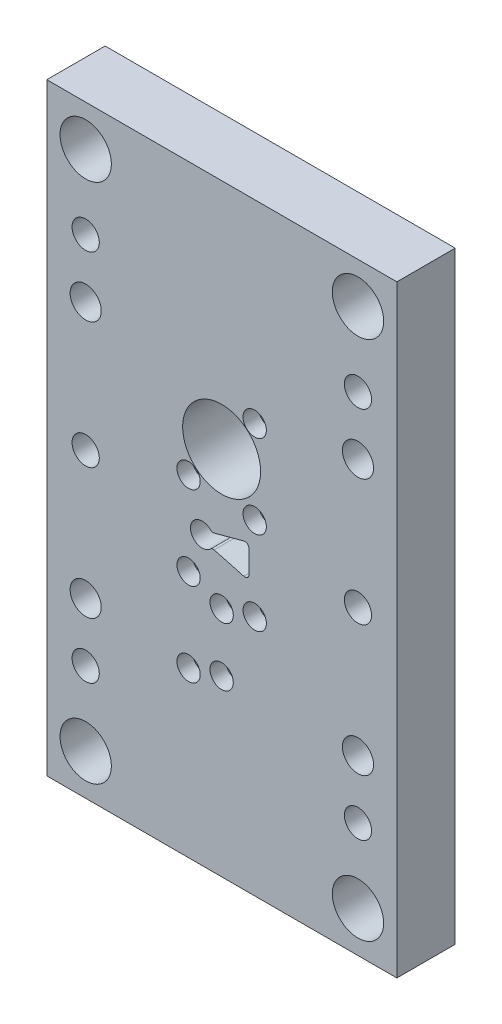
ISO-10303-21;
HEADER;
FILE_DESCRIPTION(('STEP AP214'),'2;1');
FILE_NAME('part.step','',(''),(''),'','','');
FILE_SCHEMA(('AUTOMOTIVE_DESIGN { 1 0 10303 214 1 1 1 1 }'));
ENDSEC;
DATA;
#1=APPLICATION_CONTEXT('core data for automotive mechanical design processes');
#2=APPLICATION_PROTOCOL_DEFINITION('international standard','automotive_design',2000,#1);
#3=PRODUCT_CONTEXT('',#1,'mechanical');
#4=PRODUCT('Part','Part','',(#3));
#5=PRODUCT_RELATED_PRODUCT_CATEGORY('part','',(#4));
#6=PRODUCT_DEFINITION_FORMATION('','',#4);
#7=PRODUCT_DEFINITION_CONTEXT('part definition',#1,'design');
#8=PRODUCT_DEFINITION('design','',#6,#7);
#9=PRODUCT_DEFINITION_SHAPE('','',#8);
#10=(LENGTH_UNIT() NAMED_UNIT(*) SI_UNIT(.MILLI.,.METRE.));
#11=(NAMED_UNIT(*) PLANE_ANGLE_UNIT() SI_UNIT($,.RADIAN.));
#12=(NAMED_UNIT(*) SI_UNIT($,.STERADIAN.) SOLID_ANGLE_UNIT());
#13=UNCERTAINTY_MEASURE_WITH_UNIT(LENGTH_MEASURE(1.E-05),#10,'distance_accuracy_value','');
#14=(GEOMETRIC_REPRESENTATION_CONTEXT(3) GLOBAL_UNCERTAINTY_ASSIGNED_CONTEXT((#13)) GLOBAL_UNIT_ASSIGNED_CONTEXT((#10,
#11,#12)) REPRESENTATION_CONTEXT('',''));
#15=CARTESIAN_POINT('',(0.,0.,0.));
#16=DIRECTION('',(0.,0.,1.));
#17=DIRECTION('',(1.,0.,0.));
#18=AXIS2_PLACEMENT_3D('',#15,#16,#17);
#19=CARTESIAN_POINT('',(8.45000000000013,27.6679486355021,0.));
#20=DIRECTION('',(0.,0.,1.));
#21=DIRECTION('',(1.,0.,0.));
#22=AXIS2_PLACEMENT_3D('',#19,#20,#21);
#23=CYLINDRICAL_SURFACE('',#22,1.5025);
#24=CARTESIAN_POINT('',(8.45000000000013,27.6679486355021,0.));
#25=DIRECTION('',(0.,0.,1.));
#26=DIRECTION('',(1.,0.,0.));
#27=AXIS2_PLACEMENT_3D('',#24,#25,#26);
#28=CIRCLE('',#27,1.5025);
#29=CARTESIAN_POINT('',(9.95250000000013,27.6679486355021,0.));
#30=VERTEX_POINT('',#29);
#31=EDGE_CURVE('E331',#30,#30,#28,.T.);
#32=ORIENTED_EDGE('',*,*,#31,.F.);
#33=EDGE_LOOP('',(#32));
#34=FACE_BOUND('',#33,.T.);
#35=CARTESIAN_POINT('',(8.45000000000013,27.6679486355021,10.9900000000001));
#36=DIRECTION('',(0.,0.,1.));
#37=DIRECTION('',(0.,-1.,0.));
#38=AXIS2_PLACEMENT_3D('',#35,#36,#37);
#39=CIRCLE('',#38,1.5025);
#40=CARTESIAN_POINT('',(8.45000000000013,26.1654486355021,10.9900000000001));
#41=VERTEX_POINT('',#40);
#42=EDGE_CURVE('E40',#41,#41,#39,.F.);
#43=ORIENTED_EDGE('',*,*,#42,.F.);
#44=EDGE_LOOP('',(#43));
#45=FACE_BOUND('',#44,.T.);
#46=ADVANCED_FACE('F36',(#34,#45),#23,.F.);
#47=CARTESIAN_POINT('',(8.45000000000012,6.16794863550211,0.));
#48=DIRECTION('',(0.,0.,1.));
#49=DIRECTION('',(1.,0.,0.));
#50=AXIS2_PLACEMENT_3D('',#47,#48,#49);
#51=CYLINDRICAL_SURFACE('',#50,1.5025);
#52=CARTESIAN_POINT('',(8.45000000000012,6.16794863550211,0.));
#53=DIRECTION('',(0.,0.,1.));
#54=DIRECTION('',(1.,0.,0.));
#55=AXIS2_PLACEMENT_3D('',#52,#53,#54);
#56=CIRCLE('',#55,1.5025);
#57=CARTESIAN_POINT('',(9.95250000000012,6.16794863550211,0.));
#58=VERTEX_POINT('',#57);
#59=EDGE_CURVE('E400',#58,#58,#56,.T.);
#60=ORIENTED_EDGE('',*,*,#59,.F.);
#61=EDGE_LOOP('',(#60));
#62=FACE_BOUND('',#61,.T.);
#63=CARTESIAN_POINT('',(8.45000000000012,6.16794863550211,10.9900000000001));
#64=DIRECTION('',(0.,0.,1.));
#65=DIRECTION('',(0.,-1.,0.));
#66=AXIS2_PLACEMENT_3D('',#63,#64,#65);
#67=CIRCLE('',#66,1.5025);
#68=CARTESIAN_POINT('',(8.45000000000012,4.66544863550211,10.9900000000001));
#69=VERTEX_POINT('',#68);
#70=EDGE_CURVE('E357',#69,#69,#67,.F.);
#71=ORIENTED_EDGE('',*,*,#70,.F.);
#72=EDGE_LOOP('',(#71));
#73=FACE_BOUND('',#72,.T.);
#74=ADVANCED_FACE('F435',(#62,#73),#51,.F.);
#75=CARTESIAN_POINT('',(-8.54999999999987,7.73205136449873,0.));
#76=DIRECTION('',(0.,0.,1.));
#77=DIRECTION('',(1.,0.,0.));
#78=AXIS2_PLACEMENT_3D('',#75,#76,#77);
#79=CYLINDRICAL_SURFACE('',#78,1.5025);
#80=CARTESIAN_POINT('',(-8.54999999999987,7.73205136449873,0.));
#81=DIRECTION('',(0.,0.,1.));
#82=DIRECTION('',(1.,0.,0.));
#83=AXIS2_PLACEMENT_3D('',#80,#81,#82);
#84=CIRCLE('',#83,1.5025);
#85=CARTESIAN_POINT('',(-7.04749999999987,7.73205136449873,0.));
#86=VERTEX_POINT('',#85);
#87=EDGE_CURVE('E398',#86,#86,#84,.T.);
#88=ORIENTED_EDGE('',*,*,#87,.F.);
#89=EDGE_LOOP('',(#88));
#90=FACE_BOUND('',#89,.T.);
#91=CARTESIAN_POINT('',(-8.54999999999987,7.73205136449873,10.9900000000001));
#92=DIRECTION('',(0.,0.,1.));
#93=DIRECTION('',(0.,-1.,0.));
#94=AXIS2_PLACEMENT_3D('',#91,#92,#93);
#95=CIRCLE('',#94,1.5025);
#96=CARTESIAN_POINT('',(-8.54999999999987,6.22955136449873,10.9900000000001));
#97=VERTEX_POINT('',#96);
#98=EDGE_CURVE('E353',#97,#97,#95,.F.);
#99=ORIENTED_EDGE('',*,*,#98,.F.);
#100=EDGE_LOOP('',(#99));
#101=FACE_BOUND('',#100,.T.);
#102=ADVANCED_FACE('F441',(#90,#101),#79,.F.);
#103=CARTESIAN_POINT('',(8.45000000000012,-15.3320513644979,0.));
#104=DIRECTION('',(0.,0.,1.));
#105=DIRECTION('',(1.,0.,0.));
#106=AXIS2_PLACEMENT_3D('',#103,#104,#105);
#107=CYLINDRICAL_SURFACE('',#106,1.5025);
#108=CARTESIAN_POINT('',(8.45000000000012,-15.3320513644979,0.));
#109=DIRECTION('',(0.,0.,1.));
#110=DIRECTION('',(1.,0.,0.));
#111=AXIS2_PLACEMENT_3D('',#108,#109,#110);
#112=CIRCLE('',#111,1.5025);
#113=CARTESIAN_POINT('',(9.95250000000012,-15.3320513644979,0.));
#114=VERTEX_POINT('',#113);
#115=EDGE_CURVE('E204',#114,#114,#112,.T.);
#116=ORIENTED_EDGE('',*,*,#115,.F.);
#117=EDGE_LOOP('',(#116));
#118=FACE_BOUND('',#117,.T.);
#119=CARTESIAN_POINT('',(8.45000000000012,-15.3320513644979,10.9900000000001));
#120=DIRECTION('',(0.,0.,1.));
#121=DIRECTION('',(0.,-1.,0.));
#122=AXIS2_PLACEMENT_3D('',#119,#120,#121);
#123=CIRCLE('',#122,1.5025);
#124=CARTESIAN_POINT('',(8.45000000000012,-16.8345513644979,10.9900000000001));
#125=VERTEX_POINT('',#124);
#126=EDGE_CURVE('E348',#125,#125,#123,.F.);
#127=ORIENTED_EDGE('',*,*,#126,.F.);
#128=EDGE_LOOP('',(#127));
#129=FACE_BOUND('',#128,.T.);
#130=ADVANCED_FACE('F451',(#118,#129),#107,.F.);
#131=CARTESIAN_POINT('',(-0.0499999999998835,-17.7999999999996,0.));
#132=DIRECTION('',(0.,0.,1.));
#133=DIRECTION('',(1.,0.,0.));
#134=AXIS2_PLACEMENT_3D('',#131,#132,#133);
#135=CYLINDRICAL_SURFACE('',#134,1.5025);
#136=CARTESIAN_POINT('',(-0.0499999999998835,-17.7999999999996,0.));
#137=DIRECTION('',(0.,0.,1.));
#138=DIRECTION('',(1.,0.,0.));
#139=AXIS2_PLACEMENT_3D('',#136,#137,#138);
#140=CIRCLE('',#139,1.5025);
#141=CARTESIAN_POINT('',(1.45250000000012,-17.7999999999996,0.));
#142=VERTEX_POINT('',#141);
#143=EDGE_CURVE('E187',#142,#142,#140,.T.);
#144=ORIENTED_EDGE('',*,*,#143,.F.);
#145=EDGE_LOOP('',(#144));
#146=FACE_BOUND('',#145,.T.);
#147=CARTESIAN_POINT('',(-0.0499999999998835,-17.7999999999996,10.9900000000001));
#148=DIRECTION('',(0.,0.,1.));
#149=DIRECTION('',(0.,-1.,0.));
#150=AXIS2_PLACEMENT_3D('',#147,#148,#149);
#151=CIRCLE('',#150,1.5025);
#152=CARTESIAN_POINT('',(-0.0499999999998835,-19.3024999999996,10.9900000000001));
#153=VERTEX_POINT('',#152);
#154=EDGE_CURVE('E343',#153,#153,#151,.F.);
#155=ORIENTED_EDGE('',*,*,#154,.F.);
#156=EDGE_LOOP('',(#155));
#157=FACE_BOUND('',#156,.T.);
#158=ADVANCED_FACE('F412',(#146,#157),#135,.F.);
#159=CARTESIAN_POINT('',(-8.54999999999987,-13.7679486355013,0.));
#160=DIRECTION('',(0.,0.,1.));
#161=DIRECTION('',(1.,0.,0.));
#162=AXIS2_PLACEMENT_3D('',#159,#160,#161);
#163=CYLINDRICAL_SURFACE('',#162,1.5025);
#164=CARTESIAN_POINT('',(-8.54999999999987,-13.7679486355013,0.));
#165=DIRECTION('',(0.,0.,1.));
#166=DIRECTION('',(1.,0.,0.));
#167=AXIS2_PLACEMENT_3D('',#164,#165,#166);
#168=CIRCLE('',#167,1.5025);
#169=CARTESIAN_POINT('',(-7.04749999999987,-13.7679486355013,0.));
#170=VERTEX_POINT('',#169);
#171=EDGE_CURVE('E152',#170,#170,#168,.T.);
#172=ORIENTED_EDGE('',*,*,#171,.F.);
#173=EDGE_LOOP('',(#172));
#174=FACE_BOUND('',#173,.T.);
#175=CARTESIAN_POINT('',(-8.54999999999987,-13.7679486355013,10.9900000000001));
#176=DIRECTION('',(0.,0.,1.));
#177=DIRECTION('',(0.,-1.,0.));
#178=AXIS2_PLACEMENT_3D('',#175,#176,#177);
#179=CIRCLE('',#178,1.5025);
#180=CARTESIAN_POINT('',(-8.54999999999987,-15.2704486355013,10.9900000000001));
#181=VERTEX_POINT('',#180);
#182=EDGE_CURVE('E338',#181,#181,#179,.F.);
#183=ORIENTED_EDGE('',*,*,#182,.F.);
#184=EDGE_LOOP('',(#183));
#185=FACE_BOUND('',#184,.T.);
#186=ADVANCED_FACE('F408',(#174,#185),#163,.F.);
#187=CARTESIAN_POINT('',(-0.0499999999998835,-32.7999999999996,0.));
#188=DIRECTION('',(0.,0.,1.));
#189=DIRECTION('',(1.,0.,0.));
#190=AXIS2_PLACEMENT_3D('',#187,#188,#189);
#191=CYLINDRICAL_SURFACE('',#190,1.5025);
#192=CARTESIAN_POINT('',(-0.0499999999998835,-32.7999999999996,0.));
#193=DIRECTION('',(0.,0.,1.));
#194=DIRECTION('',(1.,0.,0.));
#195=AXIS2_PLACEMENT_3D('',#192,#193,#194);
#196=CIRCLE('',#195,1.5025);
#197=CARTESIAN_POINT('',(1.45250000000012,-32.7999999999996,0.));
#198=VERTEX_POINT('',#197);
#199=EDGE_CURVE('E201',#198,#198,#196,.T.);
#200=ORIENTED_EDGE('',*,*,#199,.F.);
#201=EDGE_LOOP('',(#200));
#202=FACE_BOUND('',#201,.T.);
#203=CARTESIAN_POINT('',(-0.0499999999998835,-32.7999999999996,10.9900000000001));
#204=DIRECTION('',(0.,0.,1.));
#205=DIRECTION('',(0.,-1.,0.));
#206=AXIS2_PLACEMENT_3D('',#203,#204,#205);
#207=CIRCLE('',#206,1.5025);
#208=CARTESIAN_POINT('',(-0.0499999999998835,-34.3024999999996,10.9900000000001));
#209=VERTEX_POINT('',#208);
#210=EDGE_CURVE('E333',#209,#209,#207,.F.);
#211=ORIENTED_EDGE('',*,*,#210,.F.);
#212=EDGE_LOOP('',(#211));
#213=FACE_BOUND('',#212,.T.);
#214=ADVANCED_FACE('F411',(#202,#213),#191,.F.);
#215=CARTESIAN_POINT('',(-8.54999999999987,-35.2679486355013,0.));
#216=DIRECTION('',(0.,0.,1.));
#217=DIRECTION('',(1.,0.,0.));
#218=AXIS2_PLACEMENT_3D('',#215,#216,#217);
#219=CYLINDRICAL_SURFACE('',#218,1.5025);
#220=CARTESIAN_POINT('',(-8.54999999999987,-35.2679486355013,0.));
#221=DIRECTION('',(0.,0.,1.));
#222=DIRECTION('',(1.,0.,0.));
#223=AXIS2_PLACEMENT_3D('',#220,#221,#222);
#224=CIRCLE('',#223,1.5025);
#225=CARTESIAN_POINT('',(-7.04749999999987,-35.2679486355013,0.));
#226=VERTEX_POINT('',#225);
#227=EDGE_CURVE('E211',#226,#226,#224,.T.);
#228=ORIENTED_EDGE('',*,*,#227,.F.);
#229=EDGE_LOOP('',(#228));
#230=FACE_BOUND('',#229,.T.);
#231=CARTESIAN_POINT('',(-8.54999999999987,-35.2679486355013,10.9900000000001));
#232=DIRECTION('',(0.,0.,1.));
#233=DIRECTION('',(0.,-1.,0.));
#234=AXIS2_PLACEMENT_3D('',#231,#232,#233);
#235=CIRCLE('',#234,1.5025);
#236=CARTESIAN_POINT('',(-8.54999999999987,-36.7704486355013,10.9900000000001));
#237=VERTEX_POINT('',#236);
#238=EDGE_CURVE('E328',#237,#237,#235,.F.);
#239=ORIENTED_EDGE('',*,*,#238,.F.);
#240=EDGE_LOOP('',(#239));
#241=FACE_BOUND('',#240,.T.);
#242=ADVANCED_FACE('F488',(#230,#241),#219,.F.);
#243=CARTESIAN_POINT('',(-45.,-78.,15.));
#244=DIRECTION('',(0.,0.,1.));
#245=DIRECTION('',(1.,0.,0.));
#246=AXIS2_PLACEMENT_3D('',#243,#244,#245);
#247=PLANE('',#246);
#248=CARTESIAN_POINT('',(8.45000000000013,27.6679486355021,15.));
#249=DIRECTION('',(0.,0.,1.));
#250=DIRECTION('',(1.,0.,0.));
#251=AXIS2_PLACEMENT_3D('',#248,#249,#250);
#252=CIRCLE('',#251,3.);
#253=CARTESIAN_POINT('',(11.4500000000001,27.6679486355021,15.));
#254=VERTEX_POINT('',#253);
#255=EDGE_CURVE('E942',#254,#254,#252,.T.);
#256=ORIENTED_EDGE('',*,*,#255,.F.);
#257=EDGE_LOOP('',(#256));
#258=FACE_BOUND('',#257,.T.);
#259=CARTESIAN_POINT('',(8.45000000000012,6.16794863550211,15.));
#260=DIRECTION('',(0.,0.,1.));
#261=DIRECTION('',(1.,0.,0.));
#262=AXIS2_PLACEMENT_3D('',#259,#260,#261);
#263=CIRCLE('',#262,3.);
#264=CARTESIAN_POINT('',(11.4500000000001,6.16794863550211,15.));
#265=VERTEX_POINT('',#264);
#266=EDGE_CURVE('E366',#265,#265,#263,.T.);
#267=ORIENTED_EDGE('',*,*,#266,.F.);
#268=EDGE_LOOP('',(#267));
#269=FACE_BOUND('',#268,.T.);
#270=CARTESIAN_POINT('',(-8.54999999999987,7.73205136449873,15.));
#271=DIRECTION('',(0.,0.,1.));
#272=DIRECTION('',(1.,0.,0.));
#273=AXIS2_PLACEMENT_3D('',#270,#271,#272);
#274=CIRCLE('',#273,3.);
#275=CARTESIAN_POINT('',(-5.54999999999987,7.73205136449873,15.));
#276=VERTEX_POINT('',#275);
#277=EDGE_CURVE('E359',#276,#276,#274,.T.);
#278=ORIENTED_EDGE('',*,*,#277,.F.);
#279=EDGE_LOOP('',(#278));
#280=FACE_BOUND('',#279,.T.);
#281=CARTESIAN_POINT('',(8.45000000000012,-15.3320513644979,15.));
#282=DIRECTION('',(0.,0.,1.));
#283=DIRECTION('',(1.,0.,0.));
#284=AXIS2_PLACEMENT_3D('',#281,#282,#283);
#285=CIRCLE('',#284,3.);
#286=CARTESIAN_POINT('',(11.4500000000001,-15.3320513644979,15.));
#287=VERTEX_POINT('',#286);
#288=EDGE_CURVE('E355',#287,#287,#285,.T.);
#289=ORIENTED_EDGE('',*,*,#288,.F.);
#290=EDGE_LOOP('',(#289));
#291=FACE_BOUND('',#290,.T.);
#292=CARTESIAN_POINT('',(-0.0499999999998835,-17.7999999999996,15.));
#293=DIRECTION('',(0.,0.,1.));
#294=DIRECTION('',(1.,0.,0.));
#295=AXIS2_PLACEMENT_3D('',#292,#293,#294);
#296=CIRCLE('',#295,3.);
#297=CARTESIAN_POINT('',(2.95000000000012,-17.7999999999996,15.));
#298=VERTEX_POINT('',#297);
#299=EDGE_CURVE('E351',#298,#298,#296,.T.);
#300=ORIENTED_EDGE('',*,*,#299,.F.);
#301=EDGE_LOOP('',(#300));
#302=FACE_BOUND('',#301,.T.);
#303=CARTESIAN_POINT('',(-8.54999999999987,-13.7679486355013,15.));
#304=DIRECTION('',(0.,0.,1.));
#305=DIRECTION('',(1.,0.,0.));
#306=AXIS2_PLACEMENT_3D('',#303,#304,#305);
#307=CIRCLE('',#306,3.);
#308=CARTESIAN_POINT('',(-5.54999999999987,-13.7679486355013,15.));
#309=VERTEX_POINT('',#308);
#310=EDGE_CURVE('E346',#309,#309,#307,.T.);
#311=ORIENTED_EDGE('',*,*,#310,.F.);
#312=EDGE_LOOP('',(#311));
#313=FACE_BOUND('',#312,.T.);
#314=CARTESIAN_POINT('',(-0.0499999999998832,-32.7999999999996,15.));
#315=DIRECTION('',(0.,0.,1.));
#316=DIRECTION('',(1.,0.,0.));
#317=AXIS2_PLACEMENT_3D('',#314,#315,#316);
#318=CIRCLE('',#317,3.);
#319=CARTESIAN_POINT('',(2.95000000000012,-32.7999999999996,15.));
#320=VERTEX_POINT('',#319);
#321=EDGE_CURVE('E341',#320,#320,#318,.T.);
#322=ORIENTED_EDGE('',*,*,#321,.F.);
#323=EDGE_LOOP('',(#322));
#324=FACE_BOUND('',#323,.T.);
#325=CARTESIAN_POINT('',(-8.54999999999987,-35.2679486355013,15.));
#326=DIRECTION('',(0.,0.,1.));
#327=DIRECTION('',(1.,0.,0.));
#328=AXIS2_PLACEMENT_3D('',#325,#326,#327);
#329=CIRCLE('',#328,3.);
#330=CARTESIAN_POINT('',(-5.54999999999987,-35.2679486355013,15.));
#331=VERTEX_POINT('',#330);
#332=EDGE_CURVE('E336',#331,#331,#329,.T.);
#333=ORIENTED_EDGE('',*,*,#332,.F.);
#334=EDGE_LOOP('',(#333));
#335=FACE_BOUND('',#334,.T.);
#336=CARTESIAN_POINT('',(-5.04999999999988,-3.79999999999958,15.));
#337=DIRECTION('',(0.,0.,1.));
#338=DIRECTION('',(1.,0.,0.));
#339=AXIS2_PLACEMENT_3D('',#336,#337,#338);
#340=CIRCLE('',#339,3.015);
#341=CARTESIAN_POINT('',(-2.91807305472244,-1.66807305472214,15.));
#342=VERTEX_POINT('',#341);
#343=CARTESIAN_POINT('',(-2.91807305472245,-5.93192694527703,15.));
#344=VERTEX_POINT('',#343);
#345=EDGE_CURVE('E53',#342,#344,#340,.T.);
#346=ORIENTED_EDGE('',*,*,#345,.F.);
#347=CARTESIAN_POINT('',(-2.2215728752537,-0.971572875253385,15.));
#348=DIRECTION('',(0.,0.,-1.));
#349=DIRECTION('',(1.,0.,0.));
#350=AXIS2_PLACEMENT_3D('',#347,#348,#349);
#351=CIRCLE('',#350,0.985);
#352=CARTESIAN_POINT('',(-1.96663611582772,-1.92300981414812,15.));
#353=VERTEX_POINT('',#352);
#354=EDGE_CURVE('E146',#353,#342,#351,.T.);
#355=ORIENTED_EDGE('',*,*,#354,.F.);
#356=DIRECTION('',(-0.96592582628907,-0.258819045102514,0.));
#357=VECTOR('',#356,1.);
#358=CARTESIAN_POINT('',(5.68729866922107,0.127855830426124,15.));
#359=LINE('',#358,#357);
#360=CARTESIAN_POINT('',(5.68729866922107,0.127855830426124,15.));
#361=VERTEX_POINT('',#360);
#362=EDGE_CURVE('E149',#361,#353,#359,.T.);
#363=ORIENTED_EDGE('',*,*,#362,.F.);
#364=CARTESIAN_POINT('',(5.95000000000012,-0.852558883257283,15.));
#365=DIRECTION('',(0.,0.,1.));
#366=DIRECTION('',(1.,0.,0.));
#367=AXIS2_PLACEMENT_3D('',#364,#365,#366);
#368=CIRCLE('',#367,1.015);
#369=CARTESIAN_POINT('',(6.96500000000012,-0.852558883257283,15.));
#370=VERTEX_POINT('',#369);
#371=EDGE_CURVE('E180',#370,#361,#368,.T.);
#372=ORIENTED_EDGE('',*,*,#371,.F.);
#373=DIRECTION('',(0.,1.,0.));
#374=VECTOR('',#373,1.);
#375=CARTESIAN_POINT('',(6.96500000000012,-6.74744111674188,15.));
#376=LINE('',#375,#374);
#377=CARTESIAN_POINT('',(6.96500000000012,-6.74744111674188,15.));
#378=VERTEX_POINT('',#377);
#379=EDGE_CURVE('E177',#378,#370,#376,.T.);
#380=ORIENTED_EDGE('',*,*,#379,.F.);
#381=CARTESIAN_POINT('',(5.95000000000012,-6.74744111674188,15.));
#382=DIRECTION('',(0.,0.,1.));
#383=DIRECTION('',(1.,0.,0.));
#384=AXIS2_PLACEMENT_3D('',#381,#382,#383);
#385=CIRCLE('',#384,1.015);
#386=CARTESIAN_POINT('',(5.68729866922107,-7.72785583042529,15.));
#387=VERTEX_POINT('',#386);
#388=EDGE_CURVE('E174',#387,#378,#385,.T.);
#389=ORIENTED_EDGE('',*,*,#388,.F.);
#390=DIRECTION('',(0.96592582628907,-0.258819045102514,0.));
#391=VECTOR('',#390,1.);
#392=CARTESIAN_POINT('',(-1.96663611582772,-5.67699018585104,15.));
#393=LINE('',#392,#391);
#394=CARTESIAN_POINT('',(-1.96663611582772,-5.67699018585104,15.));
#395=VERTEX_POINT('',#394);
#396=EDGE_CURVE('E171',#395,#387,#393,.T.);
#397=ORIENTED_EDGE('',*,*,#396,.F.);
#398=CARTESIAN_POINT('',(-2.2215728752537,-6.62842712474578,15.));
#399=DIRECTION('',(0.,0.,-1.));
#400=DIRECTION('',(1.,0.,0.));
#401=AXIS2_PLACEMENT_3D('',#398,#399,#400);
#402=CIRCLE('',#401,0.985);
#403=EDGE_CURVE('E169',#344,#395,#402,.T.);
#404=ORIENTED_EDGE('',*,*,#403,.F.);
#405=EDGE_LOOP('',(#346,#355,#363,#372,#380,#389,#397,#404));
#406=FACE_BOUND('',#405,.T.);
#407=CARTESIAN_POINT('',(-0.049999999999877,17.7000000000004,15.));
#408=DIRECTION('',(0.,0.,1.));
#409=DIRECTION('',(1.,0.,0.));
#410=AXIS2_PLACEMENT_3D('',#407,#408,#409);
#411=CIRCLE('',#410,10.015);
#412=CARTESIAN_POINT('',(9.96500000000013,17.7000000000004,15.));
#413=VERTEX_POINT('',#412);
#414=EDGE_CURVE('E207',#413,#413,#411,.T.);
#415=ORIENTED_EDGE('',*,*,#414,.F.);
#416=EDGE_LOOP('',(#415));
#417=FACE_BOUND('',#416,.T.);
#418=CARTESIAN_POINT('',(-35.,0.,15.));
#419=DIRECTION('',(0.,0.,1.));
#420=DIRECTION('',(1.,0.,0.));
#421=AXIS2_PLACEMENT_3D('',#418,#419,#420);
#422=CIRCLE('',#421,3.49999999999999);
#423=CARTESIAN_POINT('',(-31.5,0.,15.));
#424=VERTEX_POINT('',#423);
#425=EDGE_CURVE('E239',#424,#424,#422,.T.);
#426=ORIENTED_EDGE('',*,*,#425,.F.);
#427=EDGE_LOOP('',(#426));
#428=FACE_BOUND('',#427,.T.);
#429=CARTESIAN_POINT('',(-35.,-48.,15.));
#430=DIRECTION('',(0.,0.,1.));
#431=DIRECTION('',(1.,0.,0.));
#432=AXIS2_PLACEMENT_3D('',#429,#430,#431);
#433=CIRCLE('',#432,3.49999999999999);
#434=CARTESIAN_POINT('',(-31.5,-48.,15.));
#435=VERTEX_POINT('',#434);
#436=EDGE_CURVE('E245',#435,#435,#433,.T.);
#437=ORIENTED_EDGE('',*,*,#436,.F.);
#438=EDGE_LOOP('',(#437));
#439=FACE_BOUND('',#438,.T.);
#440=CARTESIAN_POINT('',(35.,-48.,15.));
#441=DIRECTION('',(0.,0.,1.));
#442=DIRECTION('',(1.,0.,0.));
#443=AXIS2_PLACEMENT_3D('',#440,#441,#442);
#444=CIRCLE('',#443,3.49999999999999);
#445=CARTESIAN_POINT('',(38.5,-48.,15.));
#446=VERTEX_POINT('',#445);
#447=EDGE_CURVE('E251',#446,#446,#444,.T.);
#448=ORIENTED_EDGE('',*,*,#447,.F.);
#449=EDGE_LOOP('',(#448));
#450=FACE_BOUND('',#449,.T.);
#451=CARTESIAN_POINT('',(-35.,48.,15.));
#452=DIRECTION('',(0.,0.,1.));
#453=DIRECTION('',(1.,0.,0.));
#454=AXIS2_PLACEMENT_3D('',#451,#452,#453);
#455=CIRCLE('',#454,3.49999999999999);
#456=CARTESIAN_POINT('',(-31.5,48.,15.));
#457=VERTEX_POINT('',#456);
#458=EDGE_CURVE('E257',#457,#457,#455,.T.);
#459=ORIENTED_EDGE('',*,*,#458,.F.);
#460=EDGE_LOOP('',(#459));
#461=FACE_BOUND('',#460,.T.);
#462=CARTESIAN_POINT('',(35.,48.,15.));
#463=DIRECTION('',(0.,0.,1.));
#464=DIRECTION('',(1.,0.,0.));
#465=AXIS2_PLACEMENT_3D('',#462,#463,#464);
#466=CIRCLE('',#465,3.49999999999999);
#467=CARTESIAN_POINT('',(38.5,48.,15.));
#468=VERTEX_POINT('',#467);
#469=EDGE_CURVE('E263',#468,#468,#466,.T.);
#470=ORIENTED_EDGE('',*,*,#469,.F.);
#471=EDGE_LOOP('',(#470));
#472=FACE_BOUND('',#471,.T.);
#473=CARTESIAN_POINT('',(35.,0.,15.));
#474=DIRECTION('',(0.,0.,1.));
#475=DIRECTION('',(1.,0.,0.));
#476=AXIS2_PLACEMENT_3D('',#473,#474,#475);
#477=CIRCLE('',#476,3.49999999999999);
#478=CARTESIAN_POINT('',(38.5,0.,15.));
#479=VERTEX_POINT('',#478);
#480=EDGE_CURVE('E269',#479,#479,#477,.T.);
#481=ORIENTED_EDGE('',*,*,#480,.F.);
#482=EDGE_LOOP('',(#481));
#483=FACE_BOUND('',#482,.T.);
#484=CARTESIAN_POINT('',(-35.,-67.,15.));
#485=DIRECTION('',(0.,0.,1.));
#486=DIRECTION('',(1.,0.,0.));
#487=AXIS2_PLACEMENT_3D('',#484,#485,#486);
#488=CIRCLE('',#487,6.6);
#489=CARTESIAN_POINT('',(-28.4,-67.,15.));
#490=VERTEX_POINT('',#489);
#491=EDGE_CURVE('E281',#490,#490,#488,.T.);
#492=ORIENTED_EDGE('',*,*,#491,.F.);
#493=EDGE_LOOP('',(#492));
#494=FACE_BOUND('',#493,.T.);
#495=CARTESIAN_POINT('',(-35.,-33.,15.));
#496=DIRECTION('',(0.,0.,1.));
#497=DIRECTION('',(1.,0.,0.));
#498=AXIS2_PLACEMENT_3D('',#495,#496,#497);
#499=CIRCLE('',#498,4.00375);
#500=CARTESIAN_POINT('',(-30.99625,-33.,15.));
#501=VERTEX_POINT('',#500);
#502=EDGE_CURVE('E293',#501,#501,#499,.T.);
#503=ORIENTED_EDGE('',*,*,#502,.F.);
#504=EDGE_LOOP('',(#503));
#505=FACE_BOUND('',#504,.T.);
#506=CARTESIAN_POINT('',(35.,67.,15.));
#507=DIRECTION('',(0.,0.,1.));
#508=DIRECTION('',(1.,0.,0.));
#509=AXIS2_PLACEMENT_3D('',#506,#507,#508);
#510=CIRCLE('',#509,6.6);
#511=CARTESIAN_POINT('',(41.6,67.,15.));
#512=VERTEX_POINT('',#511);
#513=EDGE_CURVE('E305',#512,#512,#510,.T.);
#514=ORIENTED_EDGE('',*,*,#513,.F.);
#515=EDGE_LOOP('',(#514));
#516=FACE_BOUND('',#515,.T.);
#517=CARTESIAN_POINT('',(35.,33.,15.));
#518=DIRECTION('',(0.,0.,1.));
#519=DIRECTION('',(1.,0.,0.));
#520=AXIS2_PLACEMENT_3D('',#517,#518,#519);
#521=CIRCLE('',#520,4.00375);
#522=CARTESIAN_POINT('',(39.00375,33.,15.));
#523=VERTEX_POINT('',#522);
#524=EDGE_CURVE('E317',#523,#523,#521,.T.);
#525=ORIENTED_EDGE('',*,*,#524,.F.);
#526=EDGE_LOOP('',(#525));
#527=FACE_BOUND('',#526,.T.);
#528=CARTESIAN_POINT('',(35.,-33.,15.));
#529=DIRECTION('',(0.,0.,1.));
#530=DIRECTION('',(1.,0.,0.));
#531=AXIS2_PLACEMENT_3D('',#528,#529,#530);
#532=CIRCLE('',#531,4.00375);
#533=CARTESIAN_POINT('',(39.00375,-33.,15.));
#534=VERTEX_POINT('',#533);
#535=EDGE_CURVE('E311',#534,#534,#532,.T.);
#536=ORIENTED_EDGE('',*,*,#535,.F.);
#537=EDGE_LOOP('',(#536));
#538=FACE_BOUND('',#537,.T.);
#539=CARTESIAN_POINT('',(35.,-67.,15.));
#540=DIRECTION('',(0.,0.,1.));
#541=DIRECTION('',(1.,0.,0.));
#542=AXIS2_PLACEMENT_3D('',#539,#540,#541);
#543=CIRCLE('',#542,6.6);
#544=CARTESIAN_POINT('',(41.6,-67.,15.));
#545=VERTEX_POINT('',#544);
#546=EDGE_CURVE('E299',#545,#545,#543,.T.);
#547=ORIENTED_EDGE('',*,*,#546,.F.);
#548=EDGE_LOOP('',(#547));
#549=FACE_BOUND('',#548,.T.);
#550=CARTESIAN_POINT('',(-35.,33.,15.));
#551=DIRECTION('',(0.,0.,1.));
#552=DIRECTION('',(1.,0.,0.));
#553=AXIS2_PLACEMENT_3D('',#550,#551,#552);
#554=CIRCLE('',#553,4.00375);
#555=CARTESIAN_POINT('',(-30.99625,33.,15.));
#556=VERTEX_POINT('',#555);
#557=EDGE_CURVE('E287',#556,#556,#554,.T.);
#558=ORIENTED_EDGE('',*,*,#557,.F.);
#559=EDGE_LOOP('',(#558));
#560=FACE_BOUND('',#559,.T.);
#561=CARTESIAN_POINT('',(-35.,67.,15.));
#562=DIRECTION('',(0.,0.,1.));
#563=DIRECTION('',(1.,0.,0.));
#564=AXIS2_PLACEMENT_3D('',#561,#562,#563);
#565=CIRCLE('',#564,6.6);
#566=CARTESIAN_POINT('',(-28.4,67.,15.));
#567=VERTEX_POINT('',#566);
#568=EDGE_CURVE('E275',#567,#567,#565,.T.);
#569=ORIENTED_EDGE('',*,*,#568,.F.);
#570=EDGE_LOOP('',(#569));
#571=FACE_BOUND('',#570,.T.);
#572=DIRECTION('',(0.,-1.,0.));
#573=VECTOR('',#572,1.);
#574=CARTESIAN_POINT('',(-45.,78.,15.));
#575=LINE('',#574,#573);
#576=CARTESIAN_POINT('',(-45.,77.5,15.));
#577=VERTEX_POINT('',#576);
#578=CARTESIAN_POINT('',(-45.,-77.5,15.));
#579=VERTEX_POINT('',#578);
#580=EDGE_CURVE('E45',#577,#579,#575,.T.);
#581=ORIENTED_EDGE('',*,*,#580,.T.);
#582=DIRECTION('',(1.,0.,0.));
#583=VECTOR('',#582,1.);
#584=CARTESIAN_POINT('',(-45.,-77.5,15.));
#585=LINE('',#584,#583);
#586=CARTESIAN_POINT('',(45.,-77.5,15.));
#587=VERTEX_POINT('',#586);
#588=EDGE_CURVE('E220',#579,#587,#585,.T.);
#589=ORIENTED_EDGE('',*,*,#588,.T.);
#590=DIRECTION('',(0.,1.,0.));
#591=VECTOR('',#590,1.);
#592=CARTESIAN_POINT('',(45.,-78.,15.));
#593=LINE('',#592,#591);
#594=CARTESIAN_POINT('',(45.,77.5,15.));
#595=VERTEX_POINT('',#594);
#596=EDGE_CURVE('E12',#587,#595,#593,.T.);
#597=ORIENTED_EDGE('',*,*,#596,.T.);
#598=DIRECTION('',(-1.,0.,0.));
#599=VECTOR('',#598,1.);
#600=CARTESIAN_POINT('',(-45.,77.5,15.));
#601=LINE('',#600,#599);
#602=EDGE_CURVE('E216',#595,#577,#601,.T.);
#603=ORIENTED_EDGE('',*,*,#602,.T.);
#604=EDGE_LOOP('',(#581,#589,#597,#603));
#605=FACE_BOUND('',#604,.T.);
#606=ADVANCED_FACE('F499',(#258,#269,#280,#291,#302,#313,#324,#335,#406,#417,#428,#439,#450,
#461,#472,#483,#494,#505,#516,#527,#538,#549,#560,#571,#605),#247,.T.);
#607=CARTESIAN_POINT('',(-45.,-78.,0.));
#608=DIRECTION('',(0.,0.,1.));
#609=DIRECTION('',(1.,0.,0.));
#610=AXIS2_PLACEMENT_3D('',#607,#608,#609);
#611=PLANE('',#610);
#612=ORIENTED_EDGE('',*,*,#31,.T.);
#613=EDGE_LOOP('',(#612));
#614=FACE_BOUND('',#613,.T.);
#615=ORIENTED_EDGE('',*,*,#87,.T.);
#616=EDGE_LOOP('',(#615));
#617=FACE_BOUND('',#616,.T.);
#618=ORIENTED_EDGE('',*,*,#59,.T.);
#619=EDGE_LOOP('',(#618));
#620=FACE_BOUND('',#619,.T.);
#621=ORIENTED_EDGE('',*,*,#171,.T.);
#622=EDGE_LOOP('',(#621));
#623=FACE_BOUND('',#622,.T.);
#624=CARTESIAN_POINT('',(-2.2215728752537,-0.971572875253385,0.));
#625=DIRECTION('',(0.,0.,-1.));
#626=DIRECTION('',(1.,0.,0.));
#627=AXIS2_PLACEMENT_3D('',#624,#625,#626);
#628=CIRCLE('',#627,0.985);
#629=CARTESIAN_POINT('',(-1.96663611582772,-1.92300981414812,0.));
#630=VERTEX_POINT('',#629);
#631=CARTESIAN_POINT('',(-2.91807305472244,-1.66807305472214,0.));
#632=VERTEX_POINT('',#631);
#633=EDGE_CURVE('E135',#630,#632,#628,.T.);
#634=ORIENTED_EDGE('',*,*,#633,.T.);
#635=CARTESIAN_POINT('',(-5.04999999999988,-3.79999999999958,0.));
#636=DIRECTION('',(0.,0.,1.));
#637=DIRECTION('',(1.,0.,0.));
#638=AXIS2_PLACEMENT_3D('',#635,#636,#637);
#639=CIRCLE('',#638,3.015);
#640=CARTESIAN_POINT('',(-2.91807305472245,-5.93192694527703,0.));
#641=VERTEX_POINT('',#640);
#642=EDGE_CURVE('E129',#632,#641,#639,.T.);
#643=ORIENTED_EDGE('',*,*,#642,.T.);
#644=CARTESIAN_POINT('',(-2.2215728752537,-6.62842712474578,0.));
#645=DIRECTION('',(0.,0.,-1.));
#646=DIRECTION('',(1.,0.,0.));
#647=AXIS2_PLACEMENT_3D('',#644,#645,#646);
#648=CIRCLE('',#647,0.985);
#649=CARTESIAN_POINT('',(-1.96663611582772,-5.67699018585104,0.));
#650=VERTEX_POINT('',#649);
#651=EDGE_CURVE('E138',#641,#650,#648,.T.);
#652=ORIENTED_EDGE('',*,*,#651,.T.);
#653=DIRECTION('',(0.96592582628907,-0.258819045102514,0.));
#654=VECTOR('',#653,1.);
#655=CARTESIAN_POINT('',(-1.96663611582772,-5.67699018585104,0.));
#656=LINE('',#655,#654);
#657=CARTESIAN_POINT('',(5.68729866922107,-7.72785583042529,0.));
#658=VERTEX_POINT('',#657);
#659=EDGE_CURVE('E61',#650,#658,#656,.T.);
#660=ORIENTED_EDGE('',*,*,#659,.T.);
#661=CARTESIAN_POINT('',(5.95000000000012,-6.74744111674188,0.));
#662=DIRECTION('',(0.,0.,1.));
#663=DIRECTION('',(1.,0.,0.));
#664=AXIS2_PLACEMENT_3D('',#661,#662,#663);
#665=CIRCLE('',#664,1.015);
#666=CARTESIAN_POINT('',(6.96500000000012,-6.74744111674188,0.));
#667=VERTEX_POINT('',#666);
#668=EDGE_CURVE('E156',#658,#667,#665,.T.);
#669=ORIENTED_EDGE('',*,*,#668,.T.);
#670=DIRECTION('',(0.,1.,0.));
#671=VECTOR('',#670,1.);
#672=CARTESIAN_POINT('',(6.96500000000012,-6.74744111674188,0.));
#673=LINE('',#672,#671);
#674=CARTESIAN_POINT('',(6.96500000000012,-0.852558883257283,0.));
#675=VERTEX_POINT('',#674);
#676=EDGE_CURVE('E159',#667,#675,#673,.T.);
#677=ORIENTED_EDGE('',*,*,#676,.T.);
#678=CARTESIAN_POINT('',(5.95000000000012,-0.852558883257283,0.));
#679=DIRECTION('',(0.,0.,1.));
#680=DIRECTION('',(1.,0.,0.));
#681=AXIS2_PLACEMENT_3D('',#678,#679,#680);
#682=CIRCLE('',#681,1.015);
#683=CARTESIAN_POINT('',(5.68729866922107,0.127855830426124,0.));
#684=VERTEX_POINT('',#683);
#685=EDGE_CURVE('E162',#675,#684,#682,.T.);
#686=ORIENTED_EDGE('',*,*,#685,.T.);
#687=DIRECTION('',(-0.96592582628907,-0.258819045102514,0.));
#688=VECTOR('',#687,1.);
#689=CARTESIAN_POINT('',(5.68729866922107,0.127855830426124,0.));
#690=LINE('',#689,#688);
#691=EDGE_CURVE('E165',#684,#630,#690,.T.);
#692=ORIENTED_EDGE('',*,*,#691,.T.);
#693=EDGE_LOOP('',(#634,#643,#652,#660,#669,#677,#686,#692));
#694=FACE_BOUND('',#693,.T.);
#695=ORIENTED_EDGE('',*,*,#143,.T.);
#696=EDGE_LOOP('',(#695));
#697=FACE_BOUND('',#696,.T.);
#698=ORIENTED_EDGE('',*,*,#199,.T.);
#699=EDGE_LOOP('',(#698));
#700=FACE_BOUND('',#699,.T.);
#701=ORIENTED_EDGE('',*,*,#115,.T.);
#702=EDGE_LOOP('',(#701));
#703=FACE_BOUND('',#702,.T.);
#704=CARTESIAN_POINT('',(-0.049999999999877,17.7000000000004,0.));
#705=DIRECTION('',(0.,0.,1.));
#706=DIRECTION('',(1.,0.,0.));
#707=AXIS2_PLACEMENT_3D('',#704,#705,#706);
#708=CIRCLE('',#707,10.015);
#709=CARTESIAN_POINT('',(9.96500000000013,17.7000000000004,0.));
#710=VERTEX_POINT('',#709);
#711=EDGE_CURVE('E208',#710,#710,#708,.T.);
#712=ORIENTED_EDGE('',*,*,#711,.T.);
#713=EDGE_LOOP('',(#712));
#714=FACE_BOUND('',#713,.T.);
#715=ORIENTED_EDGE('',*,*,#227,.T.);
#716=EDGE_LOOP('',(#715));
#717=FACE_BOUND('',#716,.T.);
#718=CARTESIAN_POINT('',(-35.,0.,0.));
#719=DIRECTION('',(0.,0.,1.));
#720=DIRECTION('',(1.,0.,0.));
#721=AXIS2_PLACEMENT_3D('',#718,#719,#720);
#722=CIRCLE('',#721,3.5);
#723=CARTESIAN_POINT('',(-31.5,0.,0.));
#724=VERTEX_POINT('',#723);
#725=EDGE_CURVE('E229',#724,#724,#722,.T.);
#726=ORIENTED_EDGE('',*,*,#725,.T.);
#727=EDGE_LOOP('',(#726));
#728=FACE_BOUND('',#727,.T.);
#729=CARTESIAN_POINT('',(-35.,-48.,0.));
#730=DIRECTION('',(0.,0.,1.));
#731=DIRECTION('',(1.,0.,0.));
#732=AXIS2_PLACEMENT_3D('',#729,#730,#731);
#733=CIRCLE('',#732,3.5);
#734=CARTESIAN_POINT('',(-31.5,-48.,0.));
#735=VERTEX_POINT('',#734);
#736=EDGE_CURVE('E242',#735,#735,#733,.T.);
#737=ORIENTED_EDGE('',*,*,#736,.T.);
#738=EDGE_LOOP('',(#737));
#739=FACE_BOUND('',#738,.T.);
#740=CARTESIAN_POINT('',(35.,-48.,0.));
#741=DIRECTION('',(0.,0.,1.));
#742=DIRECTION('',(1.,0.,0.));
#743=AXIS2_PLACEMENT_3D('',#740,#741,#742);
#744=CIRCLE('',#743,3.5);
#745=CARTESIAN_POINT('',(38.5,-48.,0.));
#746=VERTEX_POINT('',#745);
#747=EDGE_CURVE('E248',#746,#746,#744,.T.);
#748=ORIENTED_EDGE('',*,*,#747,.T.);
#749=EDGE_LOOP('',(#748));
#750=FACE_BOUND('',#749,.T.);
#751=CARTESIAN_POINT('',(-35.,48.,0.));
#752=DIRECTION('',(0.,0.,1.));
#753=DIRECTION('',(1.,0.,0.));
#754=AXIS2_PLACEMENT_3D('',#751,#752,#753);
#755=CIRCLE('',#754,3.5);
#756=CARTESIAN_POINT('',(-31.5,48.,0.));
#757=VERTEX_POINT('',#756);
#758=EDGE_CURVE('E254',#757,#757,#755,.T.);
#759=ORIENTED_EDGE('',*,*,#758,.T.);
#760=EDGE_LOOP('',(#759));
#761=FACE_BOUND('',#760,.T.);
#762=CARTESIAN_POINT('',(35.,48.,0.));
#763=DIRECTION('',(0.,0.,1.));
#764=DIRECTION('',(1.,0.,0.));
#765=AXIS2_PLACEMENT_3D('',#762,#763,#764);
#766=CIRCLE('',#765,3.5);
#767=CARTESIAN_POINT('',(38.5,48.,0.));
#768=VERTEX_POINT('',#767);
#769=EDGE_CURVE('E260',#768,#768,#766,.T.);
#770=ORIENTED_EDGE('',*,*,#769,.T.);
#771=EDGE_LOOP('',(#770));
#772=FACE_BOUND('',#771,.T.);
#773=CARTESIAN_POINT('',(35.,0.,0.));
#774=DIRECTION('',(0.,0.,1.));
#775=DIRECTION('',(1.,0.,0.));
#776=AXIS2_PLACEMENT_3D('',#773,#774,#775);
#777=CIRCLE('',#776,3.5);
#778=CARTESIAN_POINT('',(38.5,0.,0.));
#779=VERTEX_POINT('',#778);
#780=EDGE_CURVE('E266',#779,#779,#777,.T.);
#781=ORIENTED_EDGE('',*,*,#780,.T.);
#782=EDGE_LOOP('',(#781));
#783=FACE_BOUND('',#782,.T.);
#784=CARTESIAN_POINT('',(-35.,-67.,0.));
#785=DIRECTION('',(0.,0.,1.));
#786=DIRECTION('',(1.,0.,0.));
#787=AXIS2_PLACEMENT_3D('',#784,#785,#786);
#788=CIRCLE('',#787,6.6);
#789=CARTESIAN_POINT('',(-28.4,-67.,0.));
#790=VERTEX_POINT('',#789);
#791=EDGE_CURVE('E278',#790,#790,#788,.T.);
#792=ORIENTED_EDGE('',*,*,#791,.T.);
#793=EDGE_LOOP('',(#792));
#794=FACE_BOUND('',#793,.T.);
#795=CARTESIAN_POINT('',(-35.,-33.,0.));
#796=DIRECTION('',(0.,0.,1.));
#797=DIRECTION('',(1.,0.,0.));
#798=AXIS2_PLACEMENT_3D('',#795,#796,#797);
#799=CIRCLE('',#798,4.00375);
#800=CARTESIAN_POINT('',(-30.99625,-33.,0.));
#801=VERTEX_POINT('',#800);
#802=EDGE_CURVE('E290',#801,#801,#799,.T.);
#803=ORIENTED_EDGE('',*,*,#802,.T.);
#804=EDGE_LOOP('',(#803));
#805=FACE_BOUND('',#804,.T.);
#806=CARTESIAN_POINT('',(35.,67.,0.));
#807=DIRECTION('',(0.,0.,1.));
#808=DIRECTION('',(1.,0.,0.));
#809=AXIS2_PLACEMENT_3D('',#806,#807,#808);
#810=CIRCLE('',#809,6.6);
#811=CARTESIAN_POINT('',(41.6,67.,0.));
#812=VERTEX_POINT('',#811);
#813=EDGE_CURVE('E302',#812,#812,#810,.T.);
#814=ORIENTED_EDGE('',*,*,#813,.T.);
#815=EDGE_LOOP('',(#814));
#816=FACE_BOUND('',#815,.T.);
#817=CARTESIAN_POINT('',(35.,33.,0.));
#818=DIRECTION('',(0.,0.,1.));
#819=DIRECTION('',(1.,0.,0.));
#820=AXIS2_PLACEMENT_3D('',#817,#818,#819);
#821=CIRCLE('',#820,4.00375);
#822=CARTESIAN_POINT('',(39.00375,33.,0.));
#823=VERTEX_POINT('',#822);
#824=EDGE_CURVE('E314',#823,#823,#821,.T.);
#825=ORIENTED_EDGE('',*,*,#824,.T.);
#826=EDGE_LOOP('',(#825));
#827=FACE_BOUND('',#826,.T.);
#828=CARTESIAN_POINT('',(35.,-33.,0.));
#829=DIRECTION('',(0.,0.,1.));
#830=DIRECTION('',(1.,0.,0.));
#831=AXIS2_PLACEMENT_3D('',#828,#829,#830);
#832=CIRCLE('',#831,4.00375);
#833=CARTESIAN_POINT('',(39.00375,-33.,0.));
#834=VERTEX_POINT('',#833);
#835=EDGE_CURVE('E308',#834,#834,#832,.T.);
#836=ORIENTED_EDGE('',*,*,#835,.T.);
#837=EDGE_LOOP('',(#836));
#838=FACE_BOUND('',#837,.T.);
#839=CARTESIAN_POINT('',(35.,-67.,0.));
#840=DIRECTION('',(0.,0.,1.));
#841=DIRECTION('',(1.,0.,0.));
#842=AXIS2_PLACEMENT_3D('',#839,#840,#841);
#843=CIRCLE('',#842,6.6);
#844=CARTESIAN_POINT('',(41.6,-67.,0.));
#845=VERTEX_POINT('',#844);
#846=EDGE_CURVE('E296',#845,#845,#843,.T.);
#847=ORIENTED_EDGE('',*,*,#846,.T.);
#848=EDGE_LOOP('',(#847));
#849=FACE_BOUND('',#848,.T.);
#850=CARTESIAN_POINT('',(-35.,33.,0.));
#851=DIRECTION('',(0.,0.,1.));
#852=DIRECTION('',(1.,0.,0.));
#853=AXIS2_PLACEMENT_3D('',#850,#851,#852);
#854=CIRCLE('',#853,4.00375);
#855=CARTESIAN_POINT('',(-30.99625,33.,0.));
#856=VERTEX_POINT('',#855);
#857=EDGE_CURVE('E284',#856,#856,#854,.T.);
#858=ORIENTED_EDGE('',*,*,#857,.T.);
#859=EDGE_LOOP('',(#858));
#860=FACE_BOUND('',#859,.T.);
#861=CARTESIAN_POINT('',(-35.,67.,0.));
#862=DIRECTION('',(0.,0.,1.));
#863=DIRECTION('',(1.,0.,0.));
#864=AXIS2_PLACEMENT_3D('',#861,#862,#863);
#865=CIRCLE('',#864,6.6);
#866=CARTESIAN_POINT('',(-28.4,67.,0.));
#867=VERTEX_POINT('',#866);
#868=EDGE_CURVE('E272',#867,#867,#865,.T.);
#869=ORIENTED_EDGE('',*,*,#868,.T.);
#870=EDGE_LOOP('',(#869));
#871=FACE_BOUND('',#870,.T.);
#872=DIRECTION('',(1.,0.,0.));
#873=VECTOR('',#872,1.);
#874=CARTESIAN_POINT('',(-45.,-77.5,0.));
#875=LINE('',#874,#873);
#876=CARTESIAN_POINT('',(-45.,-77.5,0.));
#877=VERTEX_POINT('',#876);
#878=CARTESIAN_POINT('',(45.,-77.5,0.));
#879=VERTEX_POINT('',#878);
#880=EDGE_CURVE('E219',#877,#879,#875,.T.);
#881=ORIENTED_EDGE('',*,*,#880,.F.);
#882=DIRECTION('',(0.,-1.,0.));
#883=VECTOR('',#882,1.);
#884=CARTESIAN_POINT('',(-45.,78.,0.));
#885=LINE('',#884,#883);
#886=CARTESIAN_POINT('',(-45.,77.5,0.));
#887=VERTEX_POINT('',#886);
#888=EDGE_CURVE('E320',#887,#877,#885,.T.);
#889=ORIENTED_EDGE('',*,*,#888,.F.);
#890=DIRECTION('',(-1.,0.,0.));
#891=VECTOR('',#890,1.);
#892=CARTESIAN_POINT('',(-45.,77.5,0.));
#893=LINE('',#892,#891);
#894=CARTESIAN_POINT('',(45.,77.5,0.));
#895=VERTEX_POINT('',#894);
#896=EDGE_CURVE('E217',#895,#887,#893,.T.);
#897=ORIENTED_EDGE('',*,*,#896,.F.);
#898=DIRECTION('',(0.,1.,0.));
#899=VECTOR('',#898,1.);
#900=CARTESIAN_POINT('',(45.,-78.,0.));
#901=LINE('',#900,#899);
#902=EDGE_CURVE('E323',#879,#895,#901,.T.);
#903=ORIENTED_EDGE('',*,*,#902,.F.);
#904=EDGE_LOOP('',(#881,#889,#897,#903));
#905=FACE_BOUND('',#904,.T.);
#906=ADVANCED_FACE('F142',(#614,#617,#620,#623,#694,#697,#700,#703,#714,#717,#728,#739,#750,
#761,#772,#783,#794,#805,#816,#827,#838,#849,#860,#871,#905),#611,.F.);
#907=CARTESIAN_POINT('',(-45.,78.,15.));
#908=DIRECTION('',(1.,0.,0.));
#909=DIRECTION('',(0.,0.,-1.));
#910=AXIS2_PLACEMENT_3D('',#907,#908,#909);
#911=PLANE('',#910);
#912=DIRECTION('',(0.,0.,1.));
#913=VECTOR('',#912,1.);
#914=CARTESIAN_POINT('',(-45.,-77.5,0.));
#915=LINE('',#914,#913);
#916=EDGE_CURVE('E230',#877,#579,#915,.T.);
#917=ORIENTED_EDGE('',*,*,#916,.T.);
#918=ORIENTED_EDGE('',*,*,#580,.F.);
#919=DIRECTION('',(0.,0.,1.));
#920=VECTOR('',#919,1.);
#921=CARTESIAN_POINT('',(-45.,77.5,0.));
#922=LINE('',#921,#920);
#923=EDGE_CURVE('E233',#887,#577,#922,.T.);
#924=ORIENTED_EDGE('',*,*,#923,.F.);
#925=ORIENTED_EDGE('',*,*,#888,.T.);
#926=EDGE_LOOP('',(#917,#918,#924,#925));
#927=FACE_BOUND('',#926,.T.);
#928=ADVANCED_FACE('F38',(#927),#911,.F.);
#929=CARTESIAN_POINT('',(45.,-78.,15.));
#930=DIRECTION('',(-1.,0.,0.));
#931=DIRECTION('',(0.,0.,1.));
#932=AXIS2_PLACEMENT_3D('',#929,#930,#931);
#933=PLANE('',#932);
#934=DIRECTION('',(0.,0.,1.));
#935=VECTOR('',#934,1.);
#936=CARTESIAN_POINT('',(45.,-77.5,0.));
#937=LINE('',#936,#935);
#938=EDGE_CURVE('E227',#879,#587,#937,.T.);
#939=ORIENTED_EDGE('',*,*,#938,.F.);
#940=ORIENTED_EDGE('',*,*,#902,.T.);
#941=DIRECTION('',(0.,0.,1.));
#942=VECTOR('',#941,1.);
#943=CARTESIAN_POINT('',(45.,77.5,0.));
#944=LINE('',#943,#942);
#945=EDGE_CURVE('E222',#895,#595,#944,.T.);
#946=ORIENTED_EDGE('',*,*,#945,.T.);
#947=ORIENTED_EDGE('',*,*,#596,.F.);
#948=EDGE_LOOP('',(#939,#940,#946,#947));
#949=FACE_BOUND('',#948,.T.);
#950=ADVANCED_FACE('F563',(#949),#933,.F.);
#951=CARTESIAN_POINT('',(35.,33.,15.));
#952=DIRECTION('',(0.,0.,-1.));
#953=DIRECTION('',(-1.,0.,0.));
#954=AXIS2_PLACEMENT_3D('',#951,#952,#953);
#955=CYLINDRICAL_SURFACE('',#954,4.00375);
#956=ORIENTED_EDGE('',*,*,#524,.T.);
#957=EDGE_LOOP('',(#956));
#958=FACE_BOUND('',#957,.T.);
#959=ORIENTED_EDGE('',*,*,#824,.F.);
#960=EDGE_LOOP('',(#959));
#961=FACE_BOUND('',#960,.T.);
#962=ADVANCED_FACE('F559',(#958,#961),#955,.F.);
#963=CARTESIAN_POINT('',(35.,-33.,15.));
#964=DIRECTION('',(0.,0.,-1.));
#965=DIRECTION('',(-1.,0.,0.));
#966=AXIS2_PLACEMENT_3D('',#963,#964,#965);
#967=CYLINDRICAL_SURFACE('',#966,4.00375);
#968=ORIENTED_EDGE('',*,*,#535,.T.);
#969=EDGE_LOOP('',(#968));
#970=FACE_BOUND('',#969,.T.);
#971=ORIENTED_EDGE('',*,*,#835,.F.);
#972=EDGE_LOOP('',(#971));
#973=FACE_BOUND('',#972,.T.);
#974=ADVANCED_FACE('F555',(#970,#973),#967,.F.);
#975=CARTESIAN_POINT('',(35.,67.,15.));
#976=DIRECTION('',(0.,0.,-1.));
#977=DIRECTION('',(-1.,0.,0.));
#978=AXIS2_PLACEMENT_3D('',#975,#976,#977);
#979=CYLINDRICAL_SURFACE('',#978,6.6);
#980=ORIENTED_EDGE('',*,*,#513,.T.);
#981=EDGE_LOOP('',(#980));
#982=FACE_BOUND('',#981,.T.);
#983=ORIENTED_EDGE('',*,*,#813,.F.);
#984=EDGE_LOOP('',(#983));
#985=FACE_BOUND('',#984,.T.);
#986=ADVANCED_FACE('F551',(#982,#985),#979,.F.);
#987=CARTESIAN_POINT('',(35.,-67.,15.));
#988=DIRECTION('',(0.,0.,-1.));
#989=DIRECTION('',(-1.,0.,0.));
#990=AXIS2_PLACEMENT_3D('',#987,#988,#989);
#991=CYLINDRICAL_SURFACE('',#990,6.6);
#992=ORIENTED_EDGE('',*,*,#546,.T.);
#993=EDGE_LOOP('',(#992));
#994=FACE_BOUND('',#993,.T.);
#995=ORIENTED_EDGE('',*,*,#846,.F.);
#996=EDGE_LOOP('',(#995));
#997=FACE_BOUND('',#996,.T.);
#998=ADVANCED_FACE('F547',(#994,#997),#991,.F.);
#999=CARTESIAN_POINT('',(-35.,-33.,15.));
#1000=DIRECTION('',(0.,0.,-1.));
#1001=DIRECTION('',(-1.,0.,0.));
#1002=AXIS2_PLACEMENT_3D('',#999,#1000,#1001);
#1003=CYLINDRICAL_SURFACE('',#1002,4.00375);
#1004=ORIENTED_EDGE('',*,*,#502,.T.);
#1005=EDGE_LOOP('',(#1004));
#1006=FACE_BOUND('',#1005,.T.);
#1007=ORIENTED_EDGE('',*,*,#802,.F.);
#1008=EDGE_LOOP('',(#1007));
#1009=FACE_BOUND('',#1008,.T.);
#1010=ADVANCED_FACE('F543',(#1006,#1009),#1003,.F.);
#1011=CARTESIAN_POINT('',(-35.,33.,15.));
#1012=DIRECTION('',(0.,0.,-1.));
#1013=DIRECTION('',(-1.,0.,0.));
#1014=AXIS2_PLACEMENT_3D('',#1011,#1012,#1013);
#1015=CYLINDRICAL_SURFACE('',#1014,4.00375);
#1016=ORIENTED_EDGE('',*,*,#557,.T.);
#1017=EDGE_LOOP('',(#1016));
#1018=FACE_BOUND('',#1017,.T.);
#1019=ORIENTED_EDGE('',*,*,#857,.F.);
#1020=EDGE_LOOP('',(#1019));
#1021=FACE_BOUND('',#1020,.T.);
#1022=ADVANCED_FACE('F539',(#1018,#1021),#1015,.F.);
#1023=CARTESIAN_POINT('',(-35.,-67.,15.));
#1024=DIRECTION('',(0.,0.,-1.));
#1025=DIRECTION('',(-1.,0.,0.));
#1026=AXIS2_PLACEMENT_3D('',#1023,#1024,#1025);
#1027=CYLINDRICAL_SURFACE('',#1026,6.6);
#1028=ORIENTED_EDGE('',*,*,#491,.T.);
#1029=EDGE_LOOP('',(#1028));
#1030=FACE_BOUND('',#1029,.T.);
#1031=ORIENTED_EDGE('',*,*,#791,.F.);
#1032=EDGE_LOOP('',(#1031));
#1033=FACE_BOUND('',#1032,.T.);
#1034=ADVANCED_FACE('F535',(#1030,#1033),#1027,.F.);
#1035=CARTESIAN_POINT('',(-35.,67.,15.));
#1036=DIRECTION('',(0.,0.,-1.));
#1037=DIRECTION('',(-1.,0.,0.));
#1038=AXIS2_PLACEMENT_3D('',#1035,#1036,#1037);
#1039=CYLINDRICAL_SURFACE('',#1038,6.6);
#1040=ORIENTED_EDGE('',*,*,#568,.T.);
#1041=EDGE_LOOP('',(#1040));
#1042=FACE_BOUND('',#1041,.T.);
#1043=ORIENTED_EDGE('',*,*,#868,.F.);
#1044=EDGE_LOOP('',(#1043));
#1045=FACE_BOUND('',#1044,.T.);
#1046=ADVANCED_FACE('F531',(#1042,#1045),#1039,.F.);
#1047=CARTESIAN_POINT('',(35.,0.,15.));
#1048=DIRECTION('',(0.,0.,1.));
#1049=DIRECTION('',(1.,0.,0.));
#1050=AXIS2_PLACEMENT_3D('',#1047,#1048,#1049);
#1051=CYLINDRICAL_SURFACE('',#1050,3.49999999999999);
#1052=ORIENTED_EDGE('',*,*,#780,.F.);
#1053=EDGE_LOOP('',(#1052));
#1054=FACE_BOUND('',#1053,.T.);
#1055=ORIENTED_EDGE('',*,*,#480,.T.);
#1056=EDGE_LOOP('',(#1055));
#1057=FACE_BOUND('',#1056,.T.);
#1058=ADVANCED_FACE('F527',(#1054,#1057),#1051,.F.);
#1059=CARTESIAN_POINT('',(35.,48.,15.));
#1060=DIRECTION('',(0.,0.,1.));
#1061=DIRECTION('',(1.,0.,0.));
#1062=AXIS2_PLACEMENT_3D('',#1059,#1060,#1061);
#1063=CYLINDRICAL_SURFACE('',#1062,3.49999999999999);
#1064=ORIENTED_EDGE('',*,*,#769,.F.);
#1065=EDGE_LOOP('',(#1064));
#1066=FACE_BOUND('',#1065,.T.);
#1067=ORIENTED_EDGE('',*,*,#469,.T.);
#1068=EDGE_LOOP('',(#1067));
#1069=FACE_BOUND('',#1068,.T.);
#1070=ADVANCED_FACE('F523',(#1066,#1069),#1063,.F.);
#1071=CARTESIAN_POINT('',(-35.,48.,15.));
#1072=DIRECTION('',(0.,0.,1.));
#1073=DIRECTION('',(1.,0.,0.));
#1074=AXIS2_PLACEMENT_3D('',#1071,#1072,#1073);
#1075=CYLINDRICAL_SURFACE('',#1074,3.49999999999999);
#1076=ORIENTED_EDGE('',*,*,#758,.F.);
#1077=EDGE_LOOP('',(#1076));
#1078=FACE_BOUND('',#1077,.T.);
#1079=ORIENTED_EDGE('',*,*,#458,.T.);
#1080=EDGE_LOOP('',(#1079));
#1081=FACE_BOUND('',#1080,.T.);
#1082=ADVANCED_FACE('F519',(#1078,#1081),#1075,.F.);
#1083=CARTESIAN_POINT('',(35.,-48.,15.));
#1084=DIRECTION('',(0.,0.,1.));
#1085=DIRECTION('',(1.,0.,0.));
#1086=AXIS2_PLACEMENT_3D('',#1083,#1084,#1085);
#1087=CYLINDRICAL_SURFACE('',#1086,3.49999999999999);
#1088=ORIENTED_EDGE('',*,*,#747,.F.);
#1089=EDGE_LOOP('',(#1088));
#1090=FACE_BOUND('',#1089,.T.);
#1091=ORIENTED_EDGE('',*,*,#447,.T.);
#1092=EDGE_LOOP('',(#1091));
#1093=FACE_BOUND('',#1092,.T.);
#1094=ADVANCED_FACE('F515',(#1090,#1093),#1087,.F.);
#1095=CARTESIAN_POINT('',(-35.,-48.,15.));
#1096=DIRECTION('',(0.,0.,1.));
#1097=DIRECTION('',(1.,0.,0.));
#1098=AXIS2_PLACEMENT_3D('',#1095,#1096,#1097);
#1099=CYLINDRICAL_SURFACE('',#1098,3.49999999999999);
#1100=ORIENTED_EDGE('',*,*,#736,.F.);
#1101=EDGE_LOOP('',(#1100));
#1102=FACE_BOUND('',#1101,.T.);
#1103=ORIENTED_EDGE('',*,*,#436,.T.);
#1104=EDGE_LOOP('',(#1103));
#1105=FACE_BOUND('',#1104,.T.);
#1106=ADVANCED_FACE('F511',(#1102,#1105),#1099,.F.);
#1107=CARTESIAN_POINT('',(-35.,0.,15.));
#1108=DIRECTION('',(0.,0.,1.));
#1109=DIRECTION('',(1.,0.,0.));
#1110=AXIS2_PLACEMENT_3D('',#1107,#1108,#1109);
#1111=CYLINDRICAL_SURFACE('',#1110,3.49999999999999);
#1112=ORIENTED_EDGE('',*,*,#725,.F.);
#1113=EDGE_LOOP('',(#1112));
#1114=FACE_BOUND('',#1113,.T.);
#1115=ORIENTED_EDGE('',*,*,#425,.T.);
#1116=EDGE_LOOP('',(#1115));
#1117=FACE_BOUND('',#1116,.T.);
#1118=ADVANCED_FACE('F507',(#1114,#1117),#1111,.F.);
#1119=CARTESIAN_POINT('',(-45.,77.5,0.));
#1120=DIRECTION('',(0.,1.,0.));
#1121=DIRECTION('',(-1.,0.,0.));
#1122=AXIS2_PLACEMENT_3D('',#1119,#1120,#1121);
#1123=PLANE('',#1122);
#1124=ORIENTED_EDGE('',*,*,#602,.F.);
#1125=ORIENTED_EDGE('',*,*,#945,.F.);
#1126=ORIENTED_EDGE('',*,*,#896,.T.);
#1127=ORIENTED_EDGE('',*,*,#923,.T.);
#1128=EDGE_LOOP('',(#1124,#1125,#1126,#1127));
#1129=FACE_BOUND('',#1128,.T.);
#1130=ADVANCED_FACE('F503',(#1129),#1123,.T.);
#1131=CARTESIAN_POINT('',(-45.,-77.5,0.));
#1132=DIRECTION('',(0.,-1.,0.));
#1133=DIRECTION('',(1.,0.,0.));
#1134=AXIS2_PLACEMENT_3D('',#1131,#1132,#1133);
#1135=PLANE('',#1134);
#1136=ORIENTED_EDGE('',*,*,#588,.F.);
#1137=ORIENTED_EDGE('',*,*,#916,.F.);
#1138=ORIENTED_EDGE('',*,*,#880,.T.);
#1139=ORIENTED_EDGE('',*,*,#938,.T.);
#1140=EDGE_LOOP('',(#1136,#1137,#1138,#1139));
#1141=FACE_BOUND('',#1140,.T.);
#1142=ADVANCED_FACE('F495',(#1141),#1135,.T.);
#1143=CARTESIAN_POINT('',(-0.049999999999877,17.7000000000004,0.));
#1144=DIRECTION('',(0.,0.,1.));
#1145=DIRECTION('',(1.,0.,0.));
#1146=AXIS2_PLACEMENT_3D('',#1143,#1144,#1145);
#1147=CYLINDRICAL_SURFACE('',#1146,10.015);
#1148=ORIENTED_EDGE('',*,*,#711,.F.);
#1149=EDGE_LOOP('',(#1148));
#1150=FACE_BOUND('',#1149,.T.);
#1151=ORIENTED_EDGE('',*,*,#414,.T.);
#1152=EDGE_LOOP('',(#1151));
#1153=FACE_BOUND('',#1152,.T.);
#1154=ADVANCED_FACE('F482',(#1150,#1153),#1147,.F.);
#1155=CARTESIAN_POINT('',(-5.04999999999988,-3.79999999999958,0.));
#1156=DIRECTION('',(0.,0.,1.));
#1157=DIRECTION('',(1.,0.,0.));
#1158=AXIS2_PLACEMENT_3D('',#1155,#1156,#1157);
#1159=CYLINDRICAL_SURFACE('',#1158,3.015);
#1160=ORIENTED_EDGE('',*,*,#345,.T.);
#1161=DIRECTION('',(0.,0.,1.));
#1162=VECTOR('',#1161,1.);
#1163=CARTESIAN_POINT('',(-2.91807305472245,-5.93192694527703,0.));
#1164=LINE('',#1163,#1162);
#1165=EDGE_CURVE('E125',#641,#344,#1164,.T.);
#1166=ORIENTED_EDGE('',*,*,#1165,.F.);
#1167=ORIENTED_EDGE('',*,*,#642,.F.);
#1168=DIRECTION('',(0.,0.,1.));
#1169=VECTOR('',#1168,1.);
#1170=CARTESIAN_POINT('',(-2.91807305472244,-1.66807305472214,0.));
#1171=LINE('',#1170,#1169);
#1172=EDGE_CURVE('E185',#632,#342,#1171,.T.);
#1173=ORIENTED_EDGE('',*,*,#1172,.T.);
#1174=EDGE_LOOP('',(#1160,#1166,#1167,#1173));
#1175=FACE_BOUND('',#1174,.T.);
#1176=ADVANCED_FACE('F127',(#1175),#1159,.F.);
#1177=CARTESIAN_POINT('',(-2.2215728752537,-0.971572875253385,0.));
#1178=DIRECTION('',(0.,0.,1.));
#1179=DIRECTION('',(1.,0.,0.));
#1180=AXIS2_PLACEMENT_3D('',#1177,#1178,#1179);
#1181=CYLINDRICAL_SURFACE('',#1180,0.985);
#1182=ORIENTED_EDGE('',*,*,#354,.T.);
#1183=ORIENTED_EDGE('',*,*,#1172,.F.);
#1184=ORIENTED_EDGE('',*,*,#633,.F.);
#1185=DIRECTION('',(0.,0.,1.));
#1186=VECTOR('',#1185,1.);
#1187=CARTESIAN_POINT('',(-1.96663611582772,-1.92300981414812,0.));
#1188=LINE('',#1187,#1186);
#1189=EDGE_CURVE('E188',#630,#353,#1188,.T.);
#1190=ORIENTED_EDGE('',*,*,#1189,.T.);
#1191=EDGE_LOOP('',(#1182,#1183,#1184,#1190));
#1192=FACE_BOUND('',#1191,.T.);
#1193=ADVANCED_FACE('F454',(#1192),#1181,.T.);
#1194=CARTESIAN_POINT('',(5.68729866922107,0.127855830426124,0.));
#1195=DIRECTION('',(-0.258819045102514,0.96592582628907,0.));
#1196=DIRECTION('',(-0.96592582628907,-0.258819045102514,0.));
#1197=AXIS2_PLACEMENT_3D('',#1194,#1195,#1196);
#1198=PLANE('',#1197);
#1199=ORIENTED_EDGE('',*,*,#362,.T.);
#1200=ORIENTED_EDGE('',*,*,#1189,.F.);
#1201=ORIENTED_EDGE('',*,*,#691,.F.);
#1202=DIRECTION('',(0.,0.,1.));
#1203=VECTOR('',#1202,1.);
#1204=CARTESIAN_POINT('',(5.68729866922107,0.127855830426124,0.));
#1205=LINE('',#1204,#1203);
#1206=EDGE_CURVE('E190',#684,#361,#1205,.T.);
#1207=ORIENTED_EDGE('',*,*,#1206,.T.);
#1208=EDGE_LOOP('',(#1199,#1200,#1201,#1207));
#1209=FACE_BOUND('',#1208,.T.);
#1210=ADVANCED_FACE('F457',(#1209),#1198,.F.);
#1211=CARTESIAN_POINT('',(5.95000000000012,-0.852558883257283,0.));
#1212=DIRECTION('',(0.,0.,1.));
#1213=DIRECTION('',(1.,0.,0.));
#1214=AXIS2_PLACEMENT_3D('',#1211,#1212,#1213);
#1215=CYLINDRICAL_SURFACE('',#1214,1.015);
#1216=ORIENTED_EDGE('',*,*,#371,.T.);
#1217=ORIENTED_EDGE('',*,*,#1206,.F.);
#1218=ORIENTED_EDGE('',*,*,#685,.F.);
#1219=DIRECTION('',(0.,0.,1.));
#1220=VECTOR('',#1219,1.);
#1221=CARTESIAN_POINT('',(6.96500000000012,-0.852558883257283,0.));
#1222=LINE('',#1221,#1220);
#1223=EDGE_CURVE('E192',#675,#370,#1222,.T.);
#1224=ORIENTED_EDGE('',*,*,#1223,.T.);
#1225=EDGE_LOOP('',(#1216,#1217,#1218,#1224));
#1226=FACE_BOUND('',#1225,.T.);
#1227=ADVANCED_FACE('F461',(#1226),#1215,.F.);
#1228=CARTESIAN_POINT('',(6.96500000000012,-6.74744111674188,0.));
#1229=DIRECTION('',(1.,0.,0.));
#1230=DIRECTION('',(0.,1.,0.));
#1231=AXIS2_PLACEMENT_3D('',#1228,#1229,#1230);
#1232=PLANE('',#1231);
#1233=ORIENTED_EDGE('',*,*,#379,.T.);
#1234=ORIENTED_EDGE('',*,*,#1223,.F.);
#1235=ORIENTED_EDGE('',*,*,#676,.F.);
#1236=DIRECTION('',(0.,0.,1.));
#1237=VECTOR('',#1236,1.);
#1238=CARTESIAN_POINT('',(6.96500000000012,-6.74744111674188,0.));
#1239=LINE('',#1238,#1237);
#1240=EDGE_CURVE('E194',#667,#378,#1239,.T.);
#1241=ORIENTED_EDGE('',*,*,#1240,.T.);
#1242=EDGE_LOOP('',(#1233,#1234,#1235,#1241));
#1243=FACE_BOUND('',#1242,.T.);
#1244=ADVANCED_FACE('F465',(#1243),#1232,.F.);
#1245=CARTESIAN_POINT('',(5.95000000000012,-6.74744111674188,0.));
#1246=DIRECTION('',(0.,0.,1.));
#1247=DIRECTION('',(1.,0.,0.));
#1248=AXIS2_PLACEMENT_3D('',#1245,#1246,#1247);
#1249=CYLINDRICAL_SURFACE('',#1248,1.015);
#1250=ORIENTED_EDGE('',*,*,#388,.T.);
#1251=ORIENTED_EDGE('',*,*,#1240,.F.);
#1252=ORIENTED_EDGE('',*,*,#668,.F.);
#1253=DIRECTION('',(0.,0.,1.));
#1254=VECTOR('',#1253,1.);
#1255=CARTESIAN_POINT('',(5.68729866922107,-7.72785583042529,0.));
#1256=LINE('',#1255,#1254);
#1257=EDGE_CURVE('E196',#658,#387,#1256,.T.);
#1258=ORIENTED_EDGE('',*,*,#1257,.T.);
#1259=EDGE_LOOP('',(#1250,#1251,#1252,#1258));
#1260=FACE_BOUND('',#1259,.T.);
#1261=ADVANCED_FACE('F469',(#1260),#1249,.F.);
#1262=CARTESIAN_POINT('',(-1.96663611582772,-5.67699018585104,0.));
#1263=DIRECTION('',(-0.258819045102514,-0.96592582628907,0.));
#1264=DIRECTION('',(0.96592582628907,-0.258819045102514,0.));
#1265=AXIS2_PLACEMENT_3D('',#1262,#1263,#1264);
#1266=PLANE('',#1265);
#1267=ORIENTED_EDGE('',*,*,#396,.T.);
#1268=ORIENTED_EDGE('',*,*,#1257,.F.);
#1269=ORIENTED_EDGE('',*,*,#659,.F.);
#1270=DIRECTION('',(0.,0.,1.));
#1271=VECTOR('',#1270,1.);
#1272=CARTESIAN_POINT('',(-1.96663611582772,-5.67699018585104,0.));
#1273=LINE('',#1272,#1271);
#1274=EDGE_CURVE('E134',#650,#395,#1273,.T.);
#1275=ORIENTED_EDGE('',*,*,#1274,.T.);
#1276=EDGE_LOOP('',(#1267,#1268,#1269,#1275));
#1277=FACE_BOUND('',#1276,.T.);
#1278=ADVANCED_FACE('F473',(#1277),#1266,.F.);
#1279=CARTESIAN_POINT('',(-2.2215728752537,-6.62842712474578,0.));
#1280=DIRECTION('',(0.,0.,1.));
#1281=DIRECTION('',(1.,0.,0.));
#1282=AXIS2_PLACEMENT_3D('',#1279,#1280,#1281);
#1283=CYLINDRICAL_SURFACE('',#1282,0.985);
#1284=ORIENTED_EDGE('',*,*,#403,.T.);
#1285=ORIENTED_EDGE('',*,*,#1274,.F.);
#1286=ORIENTED_EDGE('',*,*,#651,.F.);
#1287=ORIENTED_EDGE('',*,*,#1165,.T.);
#1288=EDGE_LOOP('',(#1284,#1285,#1286,#1287));
#1289=FACE_BOUND('',#1288,.T.);
#1290=ADVANCED_FACE('F139',(#1289),#1283,.T.);
#1291=CARTESIAN_POINT('',(-0.0499999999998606,-30.7999999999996,10.9900000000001));
#1292=DIRECTION('',(0.,0.,1.));
#1293=DIRECTION('',(1.,0.,0.));
#1294=AXIS2_PLACEMENT_3D('',#1291,#1292,#1293);
#1295=PLANE('',#1294);
#1296=CARTESIAN_POINT('',(-8.54999999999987,-35.2679486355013,10.9900000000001));
#1297=DIRECTION('',(0.,0.,1.));
#1298=DIRECTION('',(0.,-1.,0.));
#1299=AXIS2_PLACEMENT_3D('',#1296,#1297,#1298);
#1300=CIRCLE('',#1299,3.);
#1301=CARTESIAN_POINT('',(-8.54999999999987,-38.2679486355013,10.9900000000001));
#1302=VERTEX_POINT('',#1301);
#1303=EDGE_CURVE('E332',#1302,#1302,#1300,.F.);
#1304=ORIENTED_EDGE('',*,*,#1303,.F.);
#1305=EDGE_LOOP('',(#1304));
#1306=FACE_BOUND('',#1305,.T.);
#1307=ORIENTED_EDGE('',*,*,#238,.T.);
#1308=EDGE_LOOP('',(#1307));
#1309=FACE_BOUND('',#1308,.T.);
#1310=ADVANCED_FACE('F479',(#1306,#1309),#1295,.T.);
#1311=CARTESIAN_POINT('',(-8.54999999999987,-35.2679486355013,2.49471862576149));
#1312=DIRECTION('',(0.,0.,1.));
#1313=DIRECTION('',(1.,0.,0.));
#1314=AXIS2_PLACEMENT_3D('',#1311,#1312,#1313);
#1315=CYLINDRICAL_SURFACE('',#1314,3.);
#1316=ORIENTED_EDGE('',*,*,#1303,.T.);
#1317=EDGE_LOOP('',(#1316));
#1318=FACE_BOUND('',#1317,.T.);
#1319=ORIENTED_EDGE('',*,*,#332,.T.);
#1320=EDGE_LOOP('',(#1319));
#1321=FACE_BOUND('',#1320,.T.);
#1322=ADVANCED_FACE('F448',(#1318,#1321),#1315,.F.);
#1323=CARTESIAN_POINT('',(-0.0499999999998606,-30.7999999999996,10.9900000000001));
#1324=DIRECTION('',(0.,0.,1.));
#1325=DIRECTION('',(1.,0.,0.));
#1326=AXIS2_PLACEMENT_3D('',#1323,#1324,#1325);
#1327=PLANE('',#1326);
#1328=CARTESIAN_POINT('',(-0.0499999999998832,-32.7999999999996,10.9900000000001));
#1329=DIRECTION('',(0.,0.,1.));
#1330=DIRECTION('',(0.,-1.,0.));
#1331=AXIS2_PLACEMENT_3D('',#1328,#1329,#1330);
#1332=CIRCLE('',#1331,3.);
#1333=CARTESIAN_POINT('',(-0.0499999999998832,-35.7999999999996,10.9900000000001));
#1334=VERTEX_POINT('',#1333);
#1335=EDGE_CURVE('E337',#1334,#1334,#1332,.F.);
#1336=ORIENTED_EDGE('',*,*,#1335,.F.);
#1337=EDGE_LOOP('',(#1336));
#1338=FACE_BOUND('',#1337,.T.);
#1339=ORIENTED_EDGE('',*,*,#210,.T.);
#1340=EDGE_LOOP('',(#1339));
#1341=FACE_BOUND('',#1340,.T.);
#1342=ADVANCED_FACE('F429',(#1338,#1341),#1327,.T.);
#1343=CARTESIAN_POINT('',(-0.0499999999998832,-32.7999999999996,2.49471862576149));
#1344=DIRECTION('',(0.,0.,1.));
#1345=DIRECTION('',(1.,0.,0.));
#1346=AXIS2_PLACEMENT_3D('',#1343,#1344,#1345);
#1347=CYLINDRICAL_SURFACE('',#1346,3.);
#1348=ORIENTED_EDGE('',*,*,#1335,.T.);
#1349=EDGE_LOOP('',(#1348));
#1350=FACE_BOUND('',#1349,.T.);
#1351=ORIENTED_EDGE('',*,*,#321,.T.);
#1352=EDGE_LOOP('',(#1351));
#1353=FACE_BOUND('',#1352,.T.);
#1354=ADVANCED_FACE('F419',(#1350,#1353),#1347,.F.);
#1355=CARTESIAN_POINT('',(-0.0499999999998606,-30.7999999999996,10.9900000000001));
#1356=DIRECTION('',(0.,0.,1.));
#1357=DIRECTION('',(1.,0.,0.));
#1358=AXIS2_PLACEMENT_3D('',#1355,#1356,#1357);
#1359=PLANE('',#1358);
#1360=CARTESIAN_POINT('',(-8.54999999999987,-13.7679486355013,10.9900000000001));
#1361=DIRECTION('',(0.,0.,1.));
#1362=DIRECTION('',(0.,-1.,0.));
#1363=AXIS2_PLACEMENT_3D('',#1360,#1361,#1362);
#1364=CIRCLE('',#1363,3.);
#1365=CARTESIAN_POINT('',(-8.54999999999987,-16.7679486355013,10.9900000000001));
#1366=VERTEX_POINT('',#1365);
#1367=EDGE_CURVE('E342',#1366,#1366,#1364,.F.);
#1368=ORIENTED_EDGE('',*,*,#1367,.F.);
#1369=EDGE_LOOP('',(#1368));
#1370=FACE_BOUND('',#1369,.T.);
#1371=ORIENTED_EDGE('',*,*,#182,.T.);
#1372=EDGE_LOOP('',(#1371));
#1373=FACE_BOUND('',#1372,.T.);
#1374=ADVANCED_FACE('F416',(#1370,#1373),#1359,.T.);
#1375=CARTESIAN_POINT('',(-8.54999999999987,-13.7679486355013,2.49471862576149));
#1376=DIRECTION('',(0.,0.,1.));
#1377=DIRECTION('',(1.,0.,0.));
#1378=AXIS2_PLACEMENT_3D('',#1375,#1376,#1377);
#1379=CYLINDRICAL_SURFACE('',#1378,3.);
#1380=ORIENTED_EDGE('',*,*,#1367,.T.);
#1381=EDGE_LOOP('',(#1380));
#1382=FACE_BOUND('',#1381,.T.);
#1383=ORIENTED_EDGE('',*,*,#310,.T.);
#1384=EDGE_LOOP('',(#1383));
#1385=FACE_BOUND('',#1384,.T.);
#1386=ADVANCED_FACE('F418',(#1382,#1385),#1379,.F.);
#1387=CARTESIAN_POINT('',(-0.0499999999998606,-30.7999999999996,10.9900000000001));
#1388=DIRECTION('',(0.,0.,1.));
#1389=DIRECTION('',(1.,0.,0.));
#1390=AXIS2_PLACEMENT_3D('',#1387,#1388,#1389);
#1391=PLANE('',#1390);
#1392=CARTESIAN_POINT('',(-0.0499999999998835,-17.7999999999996,10.9900000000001));
#1393=DIRECTION('',(0.,0.,1.));
#1394=DIRECTION('',(0.,-1.,0.));
#1395=AXIS2_PLACEMENT_3D('',#1392,#1393,#1394);
#1396=CIRCLE('',#1395,3.);
#1397=CARTESIAN_POINT('',(-0.0499999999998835,-20.7999999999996,10.9900000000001));
#1398=VERTEX_POINT('',#1397);
#1399=EDGE_CURVE('E347',#1398,#1398,#1396,.F.);
#1400=ORIENTED_EDGE('',*,*,#1399,.F.);
#1401=EDGE_LOOP('',(#1400));
#1402=FACE_BOUND('',#1401,.T.);
#1403=ORIENTED_EDGE('',*,*,#154,.T.);
#1404=EDGE_LOOP('',(#1403));
#1405=FACE_BOUND('',#1404,.T.);
#1406=ADVANCED_FACE('F426',(#1402,#1405),#1391,.T.);
#1407=CARTESIAN_POINT('',(-0.0499999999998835,-17.7999999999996,2.49471862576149));
#1408=DIRECTION('',(0.,0.,1.));
#1409=DIRECTION('',(1.,0.,0.));
#1410=AXIS2_PLACEMENT_3D('',#1407,#1408,#1409);
#1411=CYLINDRICAL_SURFACE('',#1410,3.);
#1412=ORIENTED_EDGE('',*,*,#1399,.T.);
#1413=EDGE_LOOP('',(#1412));
#1414=FACE_BOUND('',#1413,.T.);
#1415=ORIENTED_EDGE('',*,*,#299,.T.);
#1416=EDGE_LOOP('',(#1415));
#1417=FACE_BOUND('',#1416,.T.);
#1418=ADVANCED_FACE('F844',(#1414,#1417),#1411,.F.);
#1419=CARTESIAN_POINT('',(-0.0499999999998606,-30.7999999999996,10.9900000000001));
#1420=DIRECTION('',(0.,0.,1.));
#1421=DIRECTION('',(1.,0.,0.));
#1422=AXIS2_PLACEMENT_3D('',#1419,#1420,#1421);
#1423=PLANE('',#1422);
#1424=CARTESIAN_POINT('',(8.45000000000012,-15.3320513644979,10.9900000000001));
#1425=DIRECTION('',(0.,0.,1.));
#1426=DIRECTION('',(0.,-1.,0.));
#1427=AXIS2_PLACEMENT_3D('',#1424,#1425,#1426);
#1428=CIRCLE('',#1427,3.);
#1429=CARTESIAN_POINT('',(8.45000000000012,-18.3320513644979,10.9900000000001));
#1430=VERTEX_POINT('',#1429);
#1431=EDGE_CURVE('E352',#1430,#1430,#1428,.F.);
#1432=ORIENTED_EDGE('',*,*,#1431,.F.);
#1433=EDGE_LOOP('',(#1432));
#1434=FACE_BOUND('',#1433,.T.);
#1435=ORIENTED_EDGE('',*,*,#126,.T.);
#1436=EDGE_LOOP('',(#1435));
#1437=FACE_BOUND('',#1436,.T.);
#1438=ADVANCED_FACE('F854',(#1434,#1437),#1423,.T.);
#1439=CARTESIAN_POINT('',(8.45000000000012,-15.3320513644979,2.49471862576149));
#1440=DIRECTION('',(0.,0.,1.));
#1441=DIRECTION('',(1.,0.,0.));
#1442=AXIS2_PLACEMENT_3D('',#1439,#1440,#1441);
#1443=CYLINDRICAL_SURFACE('',#1442,3.);
#1444=ORIENTED_EDGE('',*,*,#1431,.T.);
#1445=EDGE_LOOP('',(#1444));
#1446=FACE_BOUND('',#1445,.T.);
#1447=ORIENTED_EDGE('',*,*,#288,.T.);
#1448=EDGE_LOOP('',(#1447));
#1449=FACE_BOUND('',#1448,.T.);
#1450=ADVANCED_FACE('F863',(#1446,#1449),#1443,.F.);
#1451=CARTESIAN_POINT('',(-0.0499999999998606,-30.7999999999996,10.9900000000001));
#1452=DIRECTION('',(0.,0.,1.));
#1453=DIRECTION('',(1.,0.,0.));
#1454=AXIS2_PLACEMENT_3D('',#1451,#1452,#1453);
#1455=PLANE('',#1454);
#1456=CARTESIAN_POINT('',(-8.54999999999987,7.73205136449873,10.9900000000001));
#1457=DIRECTION('',(0.,0.,1.));
#1458=DIRECTION('',(0.,-1.,0.));
#1459=AXIS2_PLACEMENT_3D('',#1456,#1457,#1458);
#1460=CIRCLE('',#1459,3.);
#1461=CARTESIAN_POINT('',(-8.54999999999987,4.73205136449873,10.9900000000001));
#1462=VERTEX_POINT('',#1461);
#1463=EDGE_CURVE('E356',#1462,#1462,#1460,.F.);
#1464=ORIENTED_EDGE('',*,*,#1463,.F.);
#1465=EDGE_LOOP('',(#1464));
#1466=FACE_BOUND('',#1465,.T.);
#1467=ORIENTED_EDGE('',*,*,#98,.T.);
#1468=EDGE_LOOP('',(#1467));
#1469=FACE_BOUND('',#1468,.T.);
#1470=ADVANCED_FACE('F873',(#1466,#1469),#1455,.T.);
#1471=CARTESIAN_POINT('',(-8.54999999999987,7.73205136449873,2.49471862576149));
#1472=DIRECTION('',(0.,0.,1.));
#1473=DIRECTION('',(1.,0.,0.));
#1474=AXIS2_PLACEMENT_3D('',#1471,#1472,#1473);
#1475=CYLINDRICAL_SURFACE('',#1474,3.);
#1476=ORIENTED_EDGE('',*,*,#1463,.T.);
#1477=EDGE_LOOP('',(#1476));
#1478=FACE_BOUND('',#1477,.T.);
#1479=ORIENTED_EDGE('',*,*,#277,.T.);
#1480=EDGE_LOOP('',(#1479));
#1481=FACE_BOUND('',#1480,.T.);
#1482=ADVANCED_FACE('F883',(#1478,#1481),#1475,.F.);
#1483=CARTESIAN_POINT('',(-0.0499999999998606,-30.7999999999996,10.9900000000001));
#1484=DIRECTION('',(0.,0.,1.));
#1485=DIRECTION('',(1.,0.,0.));
#1486=AXIS2_PLACEMENT_3D('',#1483,#1484,#1485);
#1487=PLANE('',#1486);
#1488=CARTESIAN_POINT('',(8.45000000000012,6.16794863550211,10.9900000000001));
#1489=DIRECTION('',(0.,0.,1.));
#1490=DIRECTION('',(0.,-1.,0.));
#1491=AXIS2_PLACEMENT_3D('',#1488,#1489,#1490);
#1492=CIRCLE('',#1491,3.);
#1493=CARTESIAN_POINT('',(8.45000000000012,3.16794863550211,10.9900000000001));
#1494=VERTEX_POINT('',#1493);
#1495=EDGE_CURVE('E360',#1494,#1494,#1492,.F.);
#1496=ORIENTED_EDGE('',*,*,#1495,.F.);
#1497=EDGE_LOOP('',(#1496));
#1498=FACE_BOUND('',#1497,.T.);
#1499=ORIENTED_EDGE('',*,*,#70,.T.);
#1500=EDGE_LOOP('',(#1499));
#1501=FACE_BOUND('',#1500,.T.);
#1502=ADVANCED_FACE('F893',(#1498,#1501),#1487,.T.);
#1503=CARTESIAN_POINT('',(8.45000000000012,6.16794863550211,2.49471862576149));
#1504=DIRECTION('',(0.,0.,1.));
#1505=DIRECTION('',(1.,0.,0.));
#1506=AXIS2_PLACEMENT_3D('',#1503,#1504,#1505);
#1507=CYLINDRICAL_SURFACE('',#1506,3.);
#1508=ORIENTED_EDGE('',*,*,#1495,.T.);
#1509=EDGE_LOOP('',(#1508));
#1510=FACE_BOUND('',#1509,.T.);
#1511=ORIENTED_EDGE('',*,*,#266,.T.);
#1512=EDGE_LOOP('',(#1511));
#1513=FACE_BOUND('',#1512,.T.);
#1514=ADVANCED_FACE('F903',(#1510,#1513),#1507,.F.);
#1515=CARTESIAN_POINT('',(-0.0499999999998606,-30.7999999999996,10.9900000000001));
#1516=DIRECTION('',(0.,0.,1.));
#1517=DIRECTION('',(1.,0.,0.));
#1518=AXIS2_PLACEMENT_3D('',#1515,#1516,#1517);
#1519=PLANE('',#1518);
#1520=CARTESIAN_POINT('',(8.45000000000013,27.6679486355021,10.9900000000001));
#1521=DIRECTION('',(0.,0.,1.));
#1522=DIRECTION('',(0.,-1.,0.));
#1523=AXIS2_PLACEMENT_3D('',#1520,#1521,#1522);
#1524=CIRCLE('',#1523,3.);
#1525=CARTESIAN_POINT('',(8.45000000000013,24.6679486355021,10.9900000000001));
#1526=VERTEX_POINT('',#1525);
#1527=EDGE_CURVE('E939',#1526,#1526,#1524,.F.);
#1528=ORIENTED_EDGE('',*,*,#1527,.F.);
#1529=EDGE_LOOP('',(#1528));
#1530=FACE_BOUND('',#1529,.T.);
#1531=ORIENTED_EDGE('',*,*,#42,.T.);
#1532=EDGE_LOOP('',(#1531));
#1533=FACE_BOUND('',#1532,.T.);
#1534=ADVANCED_FACE('F913',(#1530,#1533),#1519,.T.);
#1535=CARTESIAN_POINT('',(8.45000000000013,27.6679486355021,2.49471862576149));
#1536=DIRECTION('',(0.,0.,1.));
#1537=DIRECTION('',(1.,0.,0.));
#1538=AXIS2_PLACEMENT_3D('',#1535,#1536,#1537);
#1539=CYLINDRICAL_SURFACE('',#1538,3.);
#1540=ORIENTED_EDGE('',*,*,#1527,.T.);
#1541=EDGE_LOOP('',(#1540));
#1542=FACE_BOUND('',#1541,.T.);
#1543=ORIENTED_EDGE('',*,*,#255,.T.);
#1544=EDGE_LOOP('',(#1543));
#1545=FACE_BOUND('',#1544,.T.);
#1546=ADVANCED_FACE('F922',(#1542,#1545),#1539,.F.);
#1547=CLOSED_SHELL('',(#46,#74,#102,#130,#158,#186,#214,#242,#606,#906,#928,#950,#962,#974,#986,
#998,#1010,#1022,#1034,#1046,#1058,#1070,#1082,#1094,#1106,#1118,#1130,#1142,#1154,#1176,#1193,
#1210,#1227,#1244,#1261,#1278,#1290,#1310,#1322,#1342,#1354,#1374,#1386,#1406,#1418,#1438,#1450,
#1470,#1482,#1502,#1514,#1534,#1546));
#1548=MANIFOLD_SOLID_BREP('B2',#1547);
#1549=ADVANCED_BREP_SHAPE_REPRESENTATION('',(#18,#1548),#14);
#1550=SHAPE_DEFINITION_REPRESENTATION(#9,#1549);
ENDSEC;
END-ISO-10303-21;
